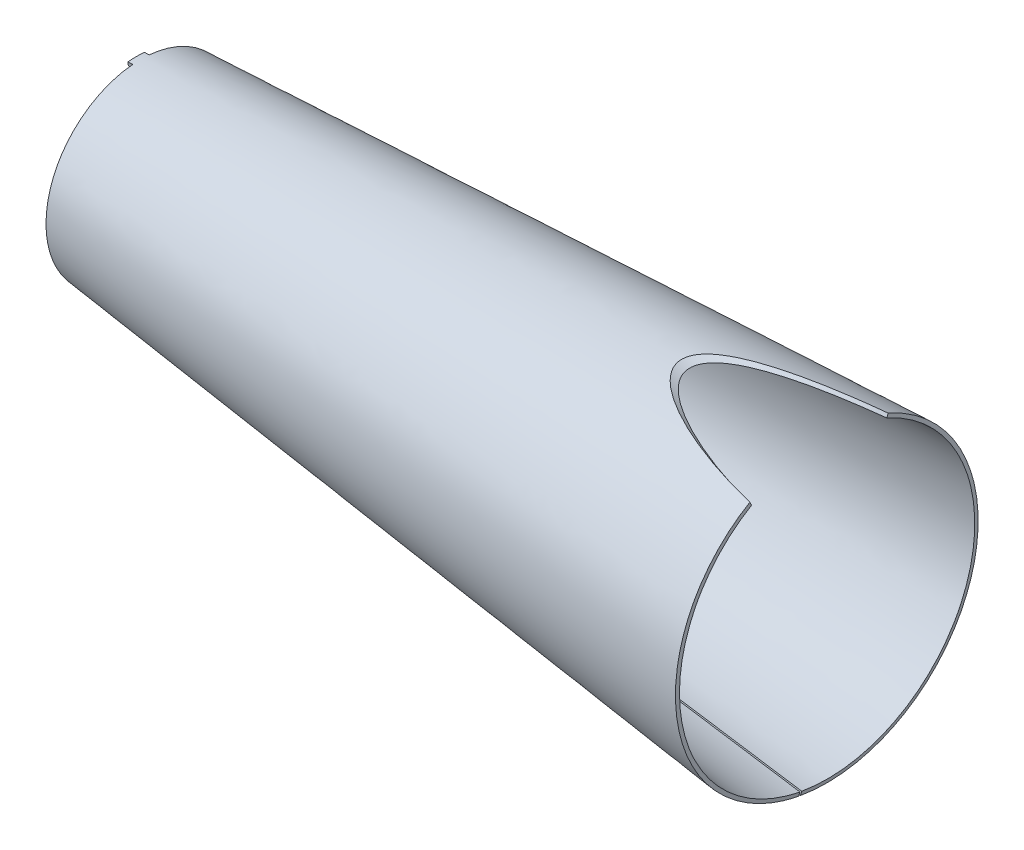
ISO-10303-21;
HEADER;
FILE_DESCRIPTION(('STEP AP214'),'2;1');
FILE_NAME('part.step','',(''),(''),'','','');
FILE_SCHEMA(('AUTOMOTIVE_DESIGN { 1 0 10303 214 1 1 1 1 }'));
ENDSEC;
DATA;
#1=APPLICATION_CONTEXT('core data for automotive mechanical design processes');
#2=APPLICATION_PROTOCOL_DEFINITION('international standard','automotive_design',2000,#1);
#3=PRODUCT_CONTEXT('',#1,'mechanical');
#4=PRODUCT('Part','Part','',(#3));
#5=PRODUCT_RELATED_PRODUCT_CATEGORY('part','',(#4));
#6=PRODUCT_DEFINITION_FORMATION('','',#4);
#7=PRODUCT_DEFINITION_CONTEXT('part definition',#1,'design');
#8=PRODUCT_DEFINITION('design','',#6,#7);
#9=PRODUCT_DEFINITION_SHAPE('','',#8);
#10=(LENGTH_UNIT() NAMED_UNIT(*) SI_UNIT(.MILLI.,.METRE.));
#11=(NAMED_UNIT(*) PLANE_ANGLE_UNIT() SI_UNIT($,.RADIAN.));
#12=(NAMED_UNIT(*) SI_UNIT($,.STERADIAN.) SOLID_ANGLE_UNIT());
#13=UNCERTAINTY_MEASURE_WITH_UNIT(LENGTH_MEASURE(1.E-05),#10,'distance_accuracy_value','');
#14=(GEOMETRIC_REPRESENTATION_CONTEXT(3) GLOBAL_UNCERTAINTY_ASSIGNED_CONTEXT((#13)) GLOBAL_UNIT_ASSIGNED_CONTEXT((#10,
#11,#12)) REPRESENTATION_CONTEXT('',''));
#15=CARTESIAN_POINT('',(0.,0.,0.));
#16=DIRECTION('',(0.,0.,1.));
#17=DIRECTION('',(1.,0.,0.));
#18=AXIS2_PLACEMENT_3D('',#15,#16,#17);
#19=CARTESIAN_POINT('',(360.294722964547,-101.661153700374,9.50772851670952));
#20=CARTESIAN_POINT('',(360.281159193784,-97.8193274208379,29.7976839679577));
#21=CARTESIAN_POINT('',(360.254687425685,-86.088863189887,47.7350527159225));
#22=CARTESIAN_POINT('',(360.187020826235,-51.9998608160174,71.043865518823));
#23=CARTESIAN_POINT('',(360.148341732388,-31.0324234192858,75.4652997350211));
#24=CARTESIAN_POINT('',(360.079214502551,9.56180295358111,67.9103687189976));
#25=CARTESIAN_POINT('',(360.051350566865,27.5330030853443,56.2420465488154));
#26=CARTESIAN_POINT('',(360.02179442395,50.9504105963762,22.2351882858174));
#27=CARTESIAN_POINT('',(360.021204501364,55.4408560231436,1.28401173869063));
#28=CARTESIAN_POINT('',(360.048859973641,48.0174495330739,-39.3328962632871));
#29=CARTESIAN_POINT('',(360.076063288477,36.40681466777,-57.3414077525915));
#30=CARTESIAN_POINT('',(360.144441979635,2.47458507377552,-80.8693349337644));
#31=CARTESIAN_POINT('',(360.183033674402,-18.4630600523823,-85.4292684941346));
#32=CARTESIAN_POINT('',(360.251485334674,-59.1102027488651,-78.1386352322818));
#33=CARTESIAN_POINT('',(360.278801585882,-77.1614672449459,-66.5845948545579));
#34=CARTESIAN_POINT('',(360.307811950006,-100.801371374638,-32.7183012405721));
#35=CARTESIAN_POINT('',(360.308510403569,-105.424427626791,-11.787901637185));
#36=CARTESIAN_POINT('',(360.295347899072,-101.836599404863,8.54836558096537));
#37=CARTESIAN_POINT('',(360.,-103.604820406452,9.87555743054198));
#38=CARTESIAN_POINT('',(360.,-99.6677428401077,30.6797038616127));
#39=CARTESIAN_POINT('',(360.,-87.6426519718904,49.0759765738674));
#40=CARTESIAN_POINT('',(360.,-52.6905916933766,72.9842562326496));
#41=CARTESIAN_POINT('',(360.,-31.1865047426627,77.5229680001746));
#42=CARTESIAN_POINT('',(360.,10.4461918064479,69.7788778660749));
#43=CARTESIAN_POINT('',(360.,28.8799532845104,57.8113343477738));
#44=CARTESIAN_POINT('',(360.,52.8973419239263,22.9341584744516));
#45=CARTESIAN_POINT('',(360.,57.5032321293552,1.44436006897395));
#46=CARTESIAN_POINT('',(360.,49.8892826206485,-40.2123335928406));
#47=CARTESIAN_POINT('',(360.,37.9794033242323,-58.6834038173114));
#48=CARTESIAN_POINT('',(360.,3.17745245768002,-82.8096668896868));
#49=CARTESIAN_POINT('',(360.,-18.2978475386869,-87.482690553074));
#50=CARTESIAN_POINT('',(360.,-59.9781315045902,-79.9989560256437));
#51=CARTESIAN_POINT('',(360.,-78.4863300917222,-68.1468572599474));
#52=CARTESIAN_POINT('',(360.,-102.721231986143,-33.4204712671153));
#53=CARTESIAN_POINT('',(360.,-107.461343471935,-11.9598794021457));
#54=CARTESIAN_POINT('',(360.,-103.784620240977,8.89185421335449));
#55=B_SPLINE_SURFACE_WITH_KNOTS('',1,3,((#19,#20,#21,#22,#23,#24,#25,#26,#27,#28,#29,#30,#31,
#32,#33,#34,#35,#36),(#37,#38,#39,#40,#41,#42,#43,#44,#45,#46,#47,#48,#49,#50,#51,#52,#53,#54)),
.UNSPECIFIED.,.F.,.F.,.F.,(2,2),(4,2,2,2,2,2,2,2,4),(0.,1.),(0.,0.125,0.25,0.375,0.5,0.625,0.75,
0.875,1.),.UNSPECIFIED.);
#56=CARTESIAN_POINT('',(360.,43.8857305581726,35.6789709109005));
#57=CARTESIAN_POINT('',(360.002828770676,43.7288596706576,35.6075180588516));
#58=CARTESIAN_POINT('',(360.005661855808,43.5723845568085,35.5351976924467));
#59=CARTESIAN_POINT('',(360.011335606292,43.2602463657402,35.388825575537));
#60=CARTESIAN_POINT('',(360.014176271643,43.1045832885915,35.314773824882));
#61=CARTESIAN_POINT('',(360.02237082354,42.6572524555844,35.0989106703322));
#62=CARTESIAN_POINT('',(360.027733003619,42.3666419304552,34.9549052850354));
#63=CARTESIAN_POINT('',(360.033103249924,42.077573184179,34.8078542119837));
#64=B_SPLINE_CURVE_WITH_KNOTS('',3,(#56,#57,#58,#59,#60,#61,#62,#63),.UNSPECIFIED.,.F.,.F.,(4,2,
2,4),(0.,0.517198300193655,1.03439664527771,2.00746261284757),.UNSPECIFIED.);
#65=CARTESIAN_POINT('',(360.,43.8857305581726,35.6789709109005));
#66=VERTEX_POINT('',#65);
#67=CARTESIAN_POINT('',(360.033098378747,42.0775606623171,34.8078466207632));
#68=VERTEX_POINT('',#67);
#69=EDGE_CURVE('E14',#66,#68,#64,.T.);
#70=CARTESIAN_POINT('',(360.,-103.784620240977,8.89185421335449));
#71=CARTESIAN_POINT('',(360.,-107.461343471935,-11.9598794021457));
#72=CARTESIAN_POINT('',(360.,-102.721231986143,-33.4204712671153));
#73=CARTESIAN_POINT('',(360.,-78.4863300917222,-68.1468572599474));
#74=CARTESIAN_POINT('',(360.,-59.9781315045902,-79.9989560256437));
#75=CARTESIAN_POINT('',(360.,-18.2978475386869,-87.482690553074));
#76=CARTESIAN_POINT('',(360.,3.17745245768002,-82.8096668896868));
#77=CARTESIAN_POINT('',(360.,37.9794033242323,-58.6834038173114));
#78=CARTESIAN_POINT('',(360.,49.8892826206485,-40.2123335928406));
#79=CARTESIAN_POINT('',(360.,57.5032321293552,1.44436006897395));
#80=CARTESIAN_POINT('',(360.,52.8973419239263,22.9341584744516));
#81=CARTESIAN_POINT('',(360.,28.8799532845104,57.8113343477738));
#82=CARTESIAN_POINT('',(360.,10.4461918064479,69.7788778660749));
#83=CARTESIAN_POINT('',(360.,-31.1865047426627,77.5229680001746));
#84=CARTESIAN_POINT('',(360.,-52.6905916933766,72.9842562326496));
#85=CARTESIAN_POINT('',(360.,-87.6426519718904,49.0759765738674));
#86=CARTESIAN_POINT('',(360.,-99.6677428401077,30.6797038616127));
#87=CARTESIAN_POINT('',(360.,-103.604820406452,9.87555743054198));
#88=B_SPLINE_CURVE_WITH_KNOTS('',3,(#70,#71,#72,#73,#74,#75,#76,#77,#78,#79,#80,#81,#82,#83,#84,
#85,#86,#87),.UNSPECIFIED.,.F.,.F.,(4,2,2,2,2,2,2,2,4),(0.,0.125,0.25,0.375,0.5,0.625,0.75,
0.875,1.),.UNSPECIFIED.);
#89=CARTESIAN_POINT('',(360.,-103.604820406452,9.87555743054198));
#90=VERTEX_POINT('',#89);
#91=EDGE_CURVE('E156',#66,#90,#88,.T.);
#92=CARTESIAN_POINT('',(360.,-103.604820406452,9.87555743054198));
#93=CARTESIAN_POINT('',(360.294722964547,-101.661153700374,9.50772851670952));
#94=B_SPLINE_CURVE_WITH_KNOTS('',1,(#92,#93),.UNSPECIFIED.,.F.,.F.,(2,2),(0.,1.),.UNSPECIFIED.);
#95=CARTESIAN_POINT('',(360.294722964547,-101.661153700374,9.50772851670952));
#96=VERTEX_POINT('',#95);
#97=EDGE_CURVE('E379',#90,#96,#94,.T.);
#98=CARTESIAN_POINT('',(360.033098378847,42.0775605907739,34.8078467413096));
#99=CARTESIAN_POINT('',(360.033697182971,41.5719718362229,35.6597490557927));
#100=CARTESIAN_POINT('',(360.034327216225,41.0501377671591,36.5020082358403));
#101=CARTESIAN_POINT('',(360.035651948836,39.9729699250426,38.1688765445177));
#102=CARTESIAN_POINT('',(360.036346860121,39.4175286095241,38.9934161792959));
#103=CARTESIAN_POINT('',(360.037798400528,38.27643769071,40.6194613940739));
#104=CARTESIAN_POINT('',(360.038554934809,37.6908349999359,41.420999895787));
#105=CARTESIAN_POINT('',(360.040126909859,36.4915019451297,42.9984798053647));
#106=CARTESIAN_POINT('',(360.040942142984,35.8778732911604,43.7744985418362));
#107=CARTESIAN_POINT('',(360.042629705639,34.6233853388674,45.300381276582));
#108=CARTESIAN_POINT('',(360.043501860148,33.9826114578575,46.0503155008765));
#109=CARTESIAN_POINT('',(360.045301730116,32.6747274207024,47.5234687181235));
#110=CARTESIAN_POINT('',(360.04622929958,32.0076879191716,48.2467504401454));
#111=CARTESIAN_POINT('',(360.048138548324,30.6481667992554,49.6660369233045));
#112=CARTESIAN_POINT('',(360.049120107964,29.9557424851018,50.3620965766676));
#113=CARTESIAN_POINT('',(360.051136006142,28.5463452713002,51.7263758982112));
#114=CARTESIAN_POINT('',(360.052170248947,27.8294176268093,52.3946423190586));
#115=CARTESIAN_POINT('',(360.054290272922,26.3719069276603,53.7027712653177));
#116=CARTESIAN_POINT('',(360.055375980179,25.6313582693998,54.3426721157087));
#117=CARTESIAN_POINT('',(360.05759776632,24.1274983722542,55.5935054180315));
#118=CARTESIAN_POINT('',(360.058733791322,23.3642117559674,56.2044674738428));
#119=CARTESIAN_POINT('',(360.061055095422,21.8157684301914,57.3968584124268));
#120=CARTESIAN_POINT('',(360.062240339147,21.0306275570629,57.9783078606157));
#121=CARTESIAN_POINT('',(360.064658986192,19.4393677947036,59.11110883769));
#122=CARTESIAN_POINT('',(360.065892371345,18.6332568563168,59.662471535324));
#123=CARTESIAN_POINT('',(360.068406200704,17.0009485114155,60.7345345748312));
#124=CARTESIAN_POINT('',(360.069686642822,16.1747519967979,61.2552362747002));
#125=CARTESIAN_POINT('',(360.072293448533,14.5031633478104,62.265413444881));
#126=CARTESIAN_POINT('',(360.073619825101,13.6577658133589,62.7548799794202));
#127=CARTESIAN_POINT('',(360.076317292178,11.9486650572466,63.7020237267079));
#128=CARTESIAN_POINT('',(360.07768840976,11.0849508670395,64.1596811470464));
#129=CARTESIAN_POINT('',(360.080474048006,9.34010555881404,65.0426445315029));
#130=CARTESIAN_POINT('',(360.081888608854,8.45895860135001,65.4679191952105));
#131=CARTESIAN_POINT('',(360.084759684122,6.68013505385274,66.2855560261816));
#132=CARTESIAN_POINT('',(360.086216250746,5.78243844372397,66.6778746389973));
#133=CARTESIAN_POINT('',(360.089169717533,3.97140109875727,67.4290394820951));
#134=CARTESIAN_POINT('',(360.090666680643,3.05803686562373,67.7878290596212));
#135=CARTESIAN_POINT('',(360.093699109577,1.21654766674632,68.4713771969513));
#136=CARTESIAN_POINT('',(360.095234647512,0.288396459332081,68.7960650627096));
#137=CARTESIAN_POINT('',(360.098342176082,-1.58178581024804,69.410852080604));
#138=CARTESIAN_POINT('',(360.099914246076,-2.52384506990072,69.7008654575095));
#139=CARTESIAN_POINT('',(360.103092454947,-4.42096526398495,70.2457476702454));
#140=CARTESIAN_POINT('',(360.104698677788,-5.37605549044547,70.5005145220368));
#141=CARTESIAN_POINT('',(360.107942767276,-7.29836312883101,70.9743457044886));
#142=CARTESIAN_POINT('',(360.109580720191,-8.26560997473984,71.1932906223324));
#143=CARTESIAN_POINT('',(360.11288302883,-10.2104397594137,71.5947424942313));
#144=CARTESIAN_POINT('',(360.114547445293,-11.1880439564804,71.7771464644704));
#145=CARTESIAN_POINT('',(360.117895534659,-13.1468751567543,72.104049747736));
#146=CARTESIAN_POINT('',(360.119579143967,-14.1280854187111,72.2486493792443));
#147=CARTESIAN_POINT('',(360.122961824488,-16.092097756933,72.4999249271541));
#148=CARTESIAN_POINT('',(360.124660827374,-17.0748842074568,72.6067229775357));
#149=CARTESIAN_POINT('',(360.128072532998,-19.0410199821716,72.7826336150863));
#150=CARTESIAN_POINT('',(360.129785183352,-20.0243598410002,72.8518520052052));
#151=CARTESIAN_POINT('',(360.133222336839,-21.9905734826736,72.9528365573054));
#152=CARTESIAN_POINT('',(360.134946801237,-22.9734426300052,72.9846929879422));
#153=CARTESIAN_POINT('',(360.138405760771,-24.9376851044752,73.011186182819));
#154=CARTESIAN_POINT('',(360.140140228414,-25.9190574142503,73.0058984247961));
#155=CARTESIAN_POINT('',(360.143617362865,-27.8792759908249,72.9583343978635));
#156=CARTESIAN_POINT('',(360.145360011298,-28.8581237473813,72.9161195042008));
#157=CARTESIAN_POINT('',(360.148851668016,-30.8122626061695,72.7949315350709));
#158=CARTESIAN_POINT('',(360.150600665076,-31.7875566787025,72.7160063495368));
#159=CARTESIAN_POINT('',(360.154103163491,-33.7335573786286,72.5216274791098));
#160=CARTESIAN_POINT('',(360.155856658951,-34.7042674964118,72.4062087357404));
#161=CARTESIAN_POINT('',(360.159366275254,-36.6400695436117,72.1390720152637));
#162=CARTESIAN_POINT('',(360.16112239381,-37.6051645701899,71.9873764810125));
#163=CARTESIAN_POINT('',(360.164635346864,-39.5287060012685,71.6479151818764));
#164=CARTESIAN_POINT('',(360.166392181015,-40.48715422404,71.4601597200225));
#165=CARTESIAN_POINT('',(360.169904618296,-42.3963722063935,71.0488074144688));
#166=CARTESIAN_POINT('',(360.171660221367,-43.3471416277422,70.8252090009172));
#167=CARTESIAN_POINT('',(360.175168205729,-45.2399730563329,70.3423995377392));
#168=CARTESIAN_POINT('',(360.176920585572,-46.1820316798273,70.0831752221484));
#169=CARTESIAN_POINT('',(360.180420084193,-48.0564137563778,69.5293425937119));
#170=CARTESIAN_POINT('',(360.182167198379,-48.9887298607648,69.2347094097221));
#171=CARTESIAN_POINT('',(360.18565407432,-50.8426006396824,68.6102875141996));
#172=CARTESIAN_POINT('',(360.187393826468,-51.7641430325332,68.2804623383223));
#173=CARTESIAN_POINT('',(360.190863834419,-53.595441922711,67.585884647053));
#174=CARTESIAN_POINT('',(360.192594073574,-54.5051801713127,67.2210840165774));
#175=CARTESIAN_POINT('',(360.196042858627,-56.3118483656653,66.4567831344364));
#176=CARTESIAN_POINT('',(360.197761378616,-57.2087529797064,66.057223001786));
#177=CARTESIAN_POINT('',(360.201184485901,-58.988733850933,65.2236302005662));
#178=CARTESIAN_POINT('',(360.202889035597,-59.8717764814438,64.7895257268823));
#179=CARTESIAN_POINT('',(360.206281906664,-61.6230157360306,63.8870701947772));
#180=CARTESIAN_POINT('',(360.207970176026,-62.4911691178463,63.418635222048));
#181=CARTESIAN_POINT('',(360.211328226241,-64.2116154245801,62.4477440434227));
#182=CARTESIAN_POINT('',(360.212997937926,-65.06385405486,61.9451916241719));
#183=CARTESIAN_POINT('',(360.216316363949,-66.7514574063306,60.9062867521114));
#184=CARTESIAN_POINT('',(360.217964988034,-67.5867552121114,60.3698256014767));
#185=CARTESIAN_POINT('',(360.221236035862,-69.2376617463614,59.264544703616));
#186=CARTESIAN_POINT('',(360.222858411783,-70.0532356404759,58.6956729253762));
#187=CARTESIAN_POINT('',(360.226069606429,-71.6593762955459,57.5291405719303));
#188=CARTESIAN_POINT('',(360.227658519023,-72.4500173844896,56.9315823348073));
#189=CARTESIAN_POINT('',(360.230799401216,-74.0055076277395,55.708702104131));
#190=CARTESIAN_POINT('',(360.232351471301,-74.7704300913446,55.0834733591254));
#191=CARTESIAN_POINT('',(360.235417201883,-76.2739203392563,53.8061460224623));
#192=CARTESIAN_POINT('',(360.236930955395,-77.0125541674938,53.1541251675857));
#193=CARTESIAN_POINT('',(360.239918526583,-78.4629017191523,51.8241053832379));
#194=CARTESIAN_POINT('',(360.24139242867,-79.1746738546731,51.1461701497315));
#195=CARTESIAN_POINT('',(360.244299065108,-80.5707314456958,49.7652133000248));
#196=CARTESIAN_POINT('',(360.245731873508,-81.2550673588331,49.0622426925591));
#197=CARTESIAN_POINT('',(360.248555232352,-82.5956847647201,47.632106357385));
#198=CARTESIAN_POINT('',(360.249945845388,-83.2520084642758,46.9049801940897));
#199=CARTESIAN_POINT('',(360.252683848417,-84.5360329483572,45.4274237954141));
#200=CARTESIAN_POINT('',(360.254031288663,-85.1637673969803,44.6770228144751));
#201=CARTESIAN_POINT('',(360.256682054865,-86.3900444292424,43.1538076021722));
#202=CARTESIAN_POINT('',(360.257985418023,-86.9886118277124,42.3810133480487));
#203=CARTESIAN_POINT('',(360.260547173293,-88.1559856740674,40.8139021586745));
#204=CARTESIAN_POINT('',(360.261805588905,-88.7248077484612,40.0195968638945));
#205=CARTESIAN_POINT('',(360.264276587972,-89.832122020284,38.4103538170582));
#206=CARTESIAN_POINT('',(360.265489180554,-90.3706202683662,37.5954202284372));
#207=CARTESIAN_POINT('',(360.267867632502,-91.4167183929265,35.9458103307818));
#208=CARTESIAN_POINT('',(360.269033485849,-91.9243142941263,35.1111315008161));
#209=CARTESIAN_POINT('',(360.27131748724,-92.9080399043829,33.4229201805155));
#210=CARTESIAN_POINT('',(360.27243561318,-93.3841550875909,32.5693792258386));
#211=CARTESIAN_POINT('',(360.274623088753,-94.3043523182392,30.84433180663));
#212=CARTESIAN_POINT('',(360.27569239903,-94.7484086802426,29.9728116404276));
#213=CARTESIAN_POINT('',(360.277781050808,-95.6039223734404,28.212692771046));
#214=CARTESIAN_POINT('',(360.278800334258,-96.0153421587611,27.3240758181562));
#215=CARTESIAN_POINT('',(360.28078760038,-96.805017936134,25.5306488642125));
#216=CARTESIAN_POINT('',(360.281755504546,-97.1832237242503,24.6258167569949));
#217=CARTESIAN_POINT('',(360.283638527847,-97.9059080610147,22.8008431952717));
#218=CARTESIAN_POINT('',(360.284553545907,-98.2503228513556,21.8806764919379));
#219=CARTESIAN_POINT('',(360.286329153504,-98.9048626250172,20.0259152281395));
#220=CARTESIAN_POINT('',(360.287189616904,-99.2149093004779,19.0912930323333));
#221=CARTESIAN_POINT('',(360.288854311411,-99.80015277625,17.2085000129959));
#222=CARTESIAN_POINT('',(360.289658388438,-100.07525563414,16.2602999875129));
#223=CARTESIAN_POINT('',(360.291208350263,-100.590047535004,14.3512267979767));
#224=CARTESIAN_POINT('',(360.291954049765,-100.829625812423,13.3903237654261));
#225=CARTESIAN_POINT('',(360.293385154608,-101.272824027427,11.4567201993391));
#226=CARTESIAN_POINT('',(360.294070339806,-101.476315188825,10.4839901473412));
#227=CARTESIAN_POINT('',(360.294722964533,-101.661153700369,9.50772851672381));
#228=B_SPLINE_CURVE_WITH_KNOTS('',3,(#98,#99,#100,#101,#102,#103,#104,#105,#106,#107,#108,#109,
#110,#111,#112,#113,#114,#115,#116,#117,#118,#119,#120,#121,#122,#123,#124,#125,#126,#127,#128,
#129,#130,#131,#132,#133,#134,#135,#136,#137,#138,#139,#140,#141,#142,#143,#144,#145,#146,#147,
#148,#149,#150,#151,#152,#153,#154,#155,#156,#157,#158,#159,#160,#161,#162,#163,#164,#165,#166,
#167,#168,#169,#170,#171,#172,#173,#174,#175,#176,#177,#178,#179,#180,#181,#182,#183,#184,#185,
#186,#187,#188,#189,#190,#191,#192,#193,#194,#195,#196,#197,#198,#199,#200,#201,#202,#203,#204,
#205,#206,#207,#208,#209,#210,#211,#212,#213,#214,#215,#216,#217,#218,#219,#220,#221,#222,#223,
#224,#225,#226,#227),.UNSPECIFIED.,.F.,.F.,(4,2,2,2,2,2,2,2,2,2,2,2,2,2,2,2,2,2,2,2,2,2,2,2,2,2,
2,2,2,2,2,2,2,2,2,2,2,2,2,2,2,2,2,2,2,2,2,2,2,2,2,2,2,2,2,2,2,2,2,2,2,2,2,2,4),(0.,
2.97172375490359,5.9535192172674,8.93080921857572,11.898040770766,14.8565433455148,
17.8075686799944,20.7522993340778,23.6918576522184,26.6273150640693,29.559701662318,
32.4900159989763,35.4192350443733,38.3483242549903,41.2782476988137,44.2099781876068,
47.1445073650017,50.0828556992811,53.0260823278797,55.975294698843,58.931657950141,
61.8964039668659,64.8708400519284,67.8535446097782,70.828251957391,73.7932585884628,
76.7498735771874,79.6993304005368,82.6427956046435,85.5813778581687,88.5161373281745,
91.4480953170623,94.3782441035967,97.3075569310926,100.236998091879,103.167533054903,
106.100138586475,109.035812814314,111.975585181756,114.920526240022,117.87175722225,
120.830459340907,123.797882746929,126.775355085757,129.757749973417,132.730198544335,
135.693296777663,138.648332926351,141.596521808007,144.539013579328,147.476902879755,
150.411238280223,153.343031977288,156.273269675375,159.202920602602,162.132947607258,
165.064317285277,167.998010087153,170.935030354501,173.876416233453,176.823249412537,
179.776664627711,182.737858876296,185.708100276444,188.688736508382),.UNSPECIFIED.);
#229=EDGE_CURVE('E383',#68,#96,#228,.T.);
#230=ORIENTED_EDGE('',*,*,#69,.F.);
#231=ORIENTED_EDGE('',*,*,#91,.T.);
#232=ORIENTED_EDGE('',*,*,#97,.T.);
#233=ORIENTED_EDGE('',*,*,#229,.F.);
#234=EDGE_LOOP('',(#230,#231,#232,#233));
#235=FACE_BOUND('',#234,.T.);
#236=ADVANCED_FACE('F59',(#235),#55,.F.);
#237=CARTESIAN_POINT('',(0.294314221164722,-47.1159871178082,9.28302272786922));
#238=CARTESIAN_POINT('',(0.287245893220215,-45.8377350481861,15.7653518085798));
#239=CARTESIAN_POINT('',(0.276594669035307,-43.3101716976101,21.6776975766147));
#240=CARTESIAN_POINT('',(0.251088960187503,-36.3531998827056,31.9813469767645));
#241=CARTESIAN_POINT('',(0.236235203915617,-31.9225594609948,36.3719980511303));
#242=CARTESIAN_POINT('',(0.203760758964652,-21.7590555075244,43.222338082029));
#243=CARTESIAN_POINT('',(0.186035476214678,-16.0273196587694,45.6812747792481));
#244=CARTESIAN_POINT('',(0.149468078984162,-3.86888337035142,48.2638125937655));
#245=CARTESIAN_POINT('',(0.13064350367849,2.55697356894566,48.3889945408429));
#246=CARTESIAN_POINT('',(0.0954197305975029,15.5306741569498,45.8981441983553));
#247=CARTESIAN_POINT('',(0.0793273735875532,21.45285090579,43.4021598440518));
#248=CARTESIAN_POINT('',(0.0533465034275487,31.7890135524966,36.5012691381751));
#249=CARTESIAN_POINT('',(0.0432915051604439,36.2016353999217,32.0951953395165));
#250=CARTESIAN_POINT('',(0.029316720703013,43.1037829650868,21.9704235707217));
#251=CARTESIAN_POINT('',(0.0253466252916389,45.5925244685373,16.2528575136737));
#252=CARTESIAN_POINT('',(0.0246567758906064,48.2384396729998,4.10989376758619));
#253=CARTESIAN_POINT('',(0.0281119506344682,48.3971627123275,-2.31464074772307));
#254=CARTESIAN_POINT('',(0.042336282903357,45.9735620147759,-15.3002800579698));
#255=CARTESIAN_POINT('',(0.052974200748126,43.5081542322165,-21.235089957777));
#256=CARTESIAN_POINT('',(0.07896448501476,36.6604682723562,-31.6065734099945));
#257=CARTESIAN_POINT('',(0.0941994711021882,32.2770516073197,-36.041904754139));
#258=CARTESIAN_POINT('',(0.127028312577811,22.1875235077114,-42.9966894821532));
#259=CARTESIAN_POINT('',(0.144703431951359,16.4825335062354,-45.5153822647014));
#260=CARTESIAN_POINT('',(0.181173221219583,4.35195163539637,-48.2252662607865));
#261=CARTESIAN_POINT('',(0.20005568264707,-2.07283442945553,-48.4180206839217));
#262=CARTESIAN_POINT('',(0.234946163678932,-15.0741322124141,-46.0623320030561));
#263=CARTESIAN_POINT('',(0.250644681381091,-21.0237373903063,-43.6275652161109));
#264=CARTESIAN_POINT('',(0.276352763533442,-31.4342948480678,-36.8316365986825));
#265=CARTESIAN_POINT('',(0.286418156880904,-35.893862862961,-32.4693352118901));
#266=CARTESIAN_POINT('',(0.300297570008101,-42.9018943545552,-22.4109840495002));
#267=CARTESIAN_POINT('',(0.304148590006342,-45.4495652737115,-16.7160570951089));
#268=CARTESIAN_POINT('',(0.305061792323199,-48.2182678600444,-4.59430645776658));
#269=CARTESIAN_POINT('',(0.30206343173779,-48.4406748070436,1.83231634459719));
#270=CARTESIAN_POINT('',(0.295347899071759,-47.2923668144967,8.33892025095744));
#271=CARTESIAN_POINT('',(0.,-49.0569000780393,9.6654309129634));
#272=CARTESIAN_POINT('',(0.,-47.727975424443,16.4103887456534));
#273=CARTESIAN_POINT('',(0.,-45.0965849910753,22.5716123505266));
#274=CARTESIAN_POINT('',(0.,-37.8535141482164,33.3053077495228));
#275=CARTESIAN_POINT('',(0.,-33.2418337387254,37.8777795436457));
#276=CARTESIAN_POINT('',(0.,-22.6628245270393,45.0126879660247));
#277=CARTESIAN_POINT('',(0.,-16.6954957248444,47.5751245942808));
#278=CARTESIAN_POINT('',(0.,-4.02983131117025,50.2686793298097));
#279=CARTESIAN_POINT('',(0.,2.668504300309,50.3997974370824));
#280=CARTESIAN_POINT('',(0.,16.1715407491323,47.8094317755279));
#281=CARTESIAN_POINT('',(0.,22.3458444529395,45.2088807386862));
#282=CARTESIAN_POINT('',(0.,33.1156214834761,38.0195695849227));
#283=CARTESIAN_POINT('',(0.,37.7110948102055,33.4308094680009));
#284=CARTESIAN_POINT('',(0.,44.8988097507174,22.8876074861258));
#285=CARTESIAN_POINT('',(0.,47.4910513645,16.9331656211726));
#286=CARTESIAN_POINT('',(0.,50.2479015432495,4.2811274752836));
#287=CARTESIAN_POINT('',(0.,50.4125101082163,-2.41646880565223));
#288=CARTESIAN_POINT('',(0.,47.8896928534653,-15.9322884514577));
#289=CARTESIAN_POINT('',(0.,45.3200462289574,-22.1195178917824));
#290=CARTESIAN_POINT('',(0.,38.184674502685,-32.9251073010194));
#291=CARTESIAN_POINT('',(0.,33.6189494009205,-37.5434672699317));
#292=CARTESIAN_POINT('',(0.,23.1118182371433,-44.7838090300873));
#293=CARTESIAN_POINT('',(0.,17.1704121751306,-47.4057908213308));
#294=CARTESIAN_POINT('',(0.,4.53231660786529,-50.2258675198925));
#295=CARTESIAN_POINT('',(0.,-2.16437289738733,-50.4239624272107));
#296=CARTESIAN_POINT('',(0.,-15.6926378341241,-47.9687566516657));
#297=CARTESIAN_POINT('',(0.,-21.8926383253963,-45.4300786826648));
#298=CARTESIAN_POINT('',(0.,-32.7337699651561,-38.3488247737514));
#299=CARTESIAN_POINT('',(0.,-37.3749011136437,-33.8062488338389));
#300=CARTESIAN_POINT('',(0.,-44.6676886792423,-23.3354511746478));
#301=CARTESIAN_POINT('',(0.,-47.3193450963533,-17.4072294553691));
#302=CARTESIAN_POINT('',(0.,-50.2025778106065,-4.78339242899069));
#303=CARTESIAN_POINT('',(0.,-50.4341541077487,1.91222287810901));
#304=CARTESIAN_POINT('',(0.,-49.2403876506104,8.68240888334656));
#305=B_SPLINE_SURFACE_WITH_KNOTS('',1,3,((#237,#238,#239,#240,#241,#242,#243,#244,#245,#246,
#247,#248,#249,#250,#251,#252,#253,#254,#255,#256,#257,#258,#259,#260,#261,#262,#263,#264,#265,
#266,#267,#268,#269,#270),(#271,#272,#273,#274,#275,#276,#277,#278,#279,#280,#281,#282,#283,
#284,#285,#286,#287,#288,#289,#290,#291,#292,#293,#294,#295,#296,#297,#298,#299,#300,#301,#302,
#303,#304)),.UNSPECIFIED.,.F.,.F.,.F.,(2,2),(4,2,2,2,2,2,2,2,2,2,2,2,2,2,2,2,4),(0.,1.),(0.,
0.0625,0.125,0.1875,0.25,0.3125,0.375,0.4375,0.5,0.5625,0.625,0.6875,0.75,0.8125,0.875,0.9375,
1.),.UNSPECIFIED.);
#306=CARTESIAN_POINT('',(0.0258323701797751,47.8270073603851,4.18432095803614));
#307=CARTESIAN_POINT('',(0.0259460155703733,47.8570327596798,3.84043001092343));
#308=CARTESIAN_POINT('',(0.0260709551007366,47.8833147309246,3.49621232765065));
#309=CARTESIAN_POINT('',(0.0263436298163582,47.9284498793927,2.80631087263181));
#310=CARTESIAN_POINT('',(0.0264914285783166,47.9472818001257,2.46062571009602));
#311=CARTESIAN_POINT('',(0.02680986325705,47.9774501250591,1.76788304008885));
#312=CARTESIAN_POINT('',(0.0269805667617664,47.9887637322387,1.42082453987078));
#313=CARTESIAN_POINT('',(0.027344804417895,48.0038300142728,0.725428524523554));
#314=CARTESIAN_POINT('',(0.0275384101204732,48.0075582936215,0.377090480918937));
#315=CARTESIAN_POINT('',(0.0279484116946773,48.0073878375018,-0.32077174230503));
#316=CARTESIAN_POINT('',(0.0281648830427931,48.0034630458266,-0.670295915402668));
#317=CARTESIAN_POINT('',(0.0286205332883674,47.987920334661,-1.37043799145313));
#318=CARTESIAN_POINT('',(0.028859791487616,47.9762746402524,-1.72105527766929));
#319=CARTESIAN_POINT('',(0.0293608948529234,47.9452231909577,-2.42329148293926));
#320=CARTESIAN_POINT('',(0.0296228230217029,47.9257878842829,-2.77490909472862));
#321=CARTESIAN_POINT('',(0.0301690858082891,47.8790917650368,-3.47905473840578));
#322=CARTESIAN_POINT('',(0.0304535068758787,47.8517995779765,-3.83158069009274));
#323=CARTESIAN_POINT('',(0.0307484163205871,47.8206249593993,-4.18376256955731));
#324=B_SPLINE_CURVE_WITH_KNOTS('',3,(#306,#307,#308,#309,#310,#311,#312,#313,#314,#315,#316,
#317,#318,#319,#320,#321,#322,#323),.UNSPECIFIED.,.F.,.F.,(4,2,2,2,2,2,2,2,4),(0.,
1.03557719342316,2.07408814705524,3.11573387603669,4.16072442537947,5.20927903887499,
6.26162630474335,7.31800427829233,8.37866057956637),.UNSPECIFIED.);
#325=CARTESIAN_POINT('',(0.0258443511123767,47.8271095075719,4.18432988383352));
#326=VERTEX_POINT('',#325);
#327=CARTESIAN_POINT('',(0.030757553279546,47.8206932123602,-4.18376860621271));
#328=VERTEX_POINT('',#327);
#329=EDGE_CURVE('E384',#326,#328,#324,.T.);
#330=CARTESIAN_POINT('',(0.0258563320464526,47.8272116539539,4.18433881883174));
#331=CARTESIAN_POINT('',(0.0236818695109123,47.9947349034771,4.19899520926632));
#332=CARTESIAN_POINT('',(0.021507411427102,48.1622581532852,4.21365159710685));
#333=CARTESIAN_POINT('',(0.0171585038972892,48.4973046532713,4.2429643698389));
#334=CARTESIAN_POINT('',(0.0149840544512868,48.6648279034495,4.25762075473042));
#335=CARTESIAN_POINT('',(0.00853972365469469,49.1613109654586,4.30105739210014));
#336=CARTESIAN_POINT('',(0.00426985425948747,49.4902707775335,4.32983764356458));
#337=CARTESIAN_POINT('',(0.,49.8192305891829,4.35861790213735));
#338=B_SPLINE_CURVE_WITH_KNOTS('',3,(#330,#331,#332,#333,#334,#335,#336,#337),.UNSPECIFIED.,.F.,
.F.,(4,2,2,4),(0.,0.504531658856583,1.00906331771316,1.99979528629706),.UNSPECIFIED.);
#339=CARTESIAN_POINT('',(0.,49.8192305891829,4.35861790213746));
#340=VERTEX_POINT('',#339);
#341=EDGE_CURVE('E497',#326,#340,#338,.T.);
#342=CARTESIAN_POINT('',(0.,-49.0569000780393,9.6654309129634));
#343=CARTESIAN_POINT('',(0.,-47.727975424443,16.4103887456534));
#344=CARTESIAN_POINT('',(0.,-45.0965849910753,22.5716123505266));
#345=CARTESIAN_POINT('',(0.,-37.8535141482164,33.3053077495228));
#346=CARTESIAN_POINT('',(0.,-33.2418337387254,37.8777795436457));
#347=CARTESIAN_POINT('',(0.,-22.6628245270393,45.0126879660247));
#348=CARTESIAN_POINT('',(0.,-16.6954957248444,47.5751245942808));
#349=CARTESIAN_POINT('',(0.,-4.02983131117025,50.2686793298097));
#350=CARTESIAN_POINT('',(0.,2.668504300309,50.3997974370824));
#351=CARTESIAN_POINT('',(0.,16.1715407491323,47.8094317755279));
#352=CARTESIAN_POINT('',(0.,22.3458444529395,45.2088807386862));
#353=CARTESIAN_POINT('',(0.,33.1156214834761,38.0195695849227));
#354=CARTESIAN_POINT('',(0.,37.7110948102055,33.4308094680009));
#355=CARTESIAN_POINT('',(0.,44.8988097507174,22.8876074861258));
#356=CARTESIAN_POINT('',(0.,47.4910513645,16.9331656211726));
#357=CARTESIAN_POINT('',(0.,50.2479015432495,4.2811274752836));
#358=CARTESIAN_POINT('',(0.,50.4125101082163,-2.41646880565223));
#359=CARTESIAN_POINT('',(0.,47.8896928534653,-15.9322884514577));
#360=CARTESIAN_POINT('',(0.,45.3200462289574,-22.1195178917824));
#361=CARTESIAN_POINT('',(0.,38.184674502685,-32.9251073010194));
#362=CARTESIAN_POINT('',(0.,33.6189494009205,-37.5434672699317));
#363=CARTESIAN_POINT('',(0.,23.1118182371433,-44.7838090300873));
#364=CARTESIAN_POINT('',(0.,17.1704121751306,-47.4057908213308));
#365=CARTESIAN_POINT('',(0.,4.53231660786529,-50.2258675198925));
#366=CARTESIAN_POINT('',(0.,-2.16437289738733,-50.4239624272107));
#367=CARTESIAN_POINT('',(0.,-15.6926378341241,-47.9687566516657));
#368=CARTESIAN_POINT('',(0.,-21.8926383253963,-45.4300786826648));
#369=CARTESIAN_POINT('',(0.,-32.7337699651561,-38.3488247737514));
#370=CARTESIAN_POINT('',(0.,-37.3749011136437,-33.8062488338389));
#371=CARTESIAN_POINT('',(0.,-44.6676886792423,-23.3354511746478));
#372=CARTESIAN_POINT('',(0.,-47.3193450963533,-17.4072294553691));
#373=CARTESIAN_POINT('',(0.,-50.2025778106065,-4.78339242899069));
#374=CARTESIAN_POINT('',(0.,-50.4341541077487,1.91222287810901));
#375=CARTESIAN_POINT('',(0.,-49.2403876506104,8.68240888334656));
#376=B_SPLINE_CURVE_WITH_KNOTS('',3,(#342,#343,#344,#345,#346,#347,#348,#349,#350,#351,#352,
#353,#354,#355,#356,#357,#358,#359,#360,#361,#362,#363,#364,#365,#366,#367,#368,#369,#370,#371,
#372,#373,#374,#375),.UNSPECIFIED.,.F.,.F.,(4,2,2,2,2,2,2,2,2,2,2,2,2,2,2,2,4),(0.,0.0625,0.125,
0.1875,0.25,0.3125,0.375,0.4375,0.5,0.5625,0.625,0.6875,0.75,0.8125,0.875,0.9375,1.),.UNSPECIFIED.);
#377=CARTESIAN_POINT('',(0.,49.8127798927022,-4.35805353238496));
#378=VERTEX_POINT('',#377);
#379=EDGE_CURVE('E350',#340,#378,#376,.T.);
#380=CARTESIAN_POINT('',(0.,49.8127798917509,-4.35805354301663));
#381=CARTESIAN_POINT('',(0.00258715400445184,49.6452624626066,-4.34339766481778));
#382=CARTESIAN_POINT('',(0.00517434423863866,49.4777450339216,-4.32874178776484));
#383=CARTESIAN_POINT('',(0.0103487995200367,49.142710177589,-4.2994300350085));
#384=CARTESIAN_POINT('',(0.0129360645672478,48.9751927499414,-4.28477415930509));
#385=CARTESIAN_POINT('',(0.020604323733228,48.4787040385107,-4.24133702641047));
#386=CARTESIAN_POINT('',(0.0256854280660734,48.1497327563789,-4.21255576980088));
#387=CARTESIAN_POINT('',(0.0307666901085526,47.8207614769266,-4.18377451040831));
#388=B_SPLINE_CURVE_WITH_KNOTS('',3,(#380,#381,#382,#383,#384,#385,#386,#387),.UNSPECIFIED.,.F.,
.F.,(4,2,2,4),(0.,0.504531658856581,1.00906331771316,1.9998642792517),.UNSPECIFIED.);
#389=EDGE_CURVE('E311',#378,#328,#388,.T.);
#390=ORIENTED_EDGE('',*,*,#329,.F.);
#391=ORIENTED_EDGE('',*,*,#341,.T.);
#392=ORIENTED_EDGE('',*,*,#379,.T.);
#393=ORIENTED_EDGE('',*,*,#389,.T.);
#394=EDGE_LOOP('',(#390,#391,#392,#393));
#395=FACE_BOUND('',#394,.T.);
#396=ADVANCED_FACE('F314',(#395),#305,.T.);
#397=CARTESIAN_POINT('',(0.,-49.0569000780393,9.6654309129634));
#398=CARTESIAN_POINT('',(360.,-103.604820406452,9.87555743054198));
#399=CARTESIAN_POINT('',(0.,-46.3990507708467,23.1553465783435));
#400=CARTESIAN_POINT('',(360.,-99.6677428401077,30.6797038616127));
#401=CARTESIAN_POINT('',(0.,-38.5313383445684,34.3103253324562));
#402=CARTESIAN_POINT('',(360.,-87.6426519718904,49.0759765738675));
#403=CARTESIAN_POINT('',(0.,-17.3733199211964,48.5801421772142));
#404=CARTESIAN_POINT('',(360.,-52.6905916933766,72.9842562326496));
#405=CARTESIAN_POINT('',(0.,-4.08301392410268,51.6949802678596));
#406=CARTESIAN_POINT('',(360.,-31.1865047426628,77.5229680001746));
#407=CARTESIAN_POINT('',(0.,22.923058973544,46.5142489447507));
#408=CARTESIAN_POINT('',(360.,10.4461918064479,69.7788778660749));
#409=CARTESIAN_POINT('',(0.,34.1172373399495,38.7024104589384));
#410=CARTESIAN_POINT('',(360.,28.8799532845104,57.8113343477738));
#411=CARTESIAN_POINT('',(0.,48.4926672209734,17.6160064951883));
#412=CARTESIAN_POINT('',(360.,52.8973419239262,22.9341584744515));
#413=CARTESIAN_POINT('',(0.,51.6739187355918,4.34144101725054));
#414=CARTESIAN_POINT('',(360.,57.5032321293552,1.44436006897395));
#415=CARTESIAN_POINT('',(0.,46.6282842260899,-22.6901982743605));
#416=CARTESIAN_POINT('',(360.,49.8892826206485,-40.2123335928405));
#417=CARTESIAN_POINT('',(0.,38.8725149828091,-33.9232963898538));
#418=CARTESIAN_POINT('',(360.,37.9794033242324,-58.6834038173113));
#419=CARTESIAN_POINT('',(0.,17.8582526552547,-48.4039799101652));
#420=CARTESIAN_POINT('',(360.,3.17745245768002,-82.8096668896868));
#421=CARTESIAN_POINT('',(0.,4.59975957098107,-51.6515653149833));
#422=CARTESIAN_POINT('',(360.,-18.2978475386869,-87.482690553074));
#423=CARTESIAN_POINT('',(0.,-22.4567703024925,-46.7411537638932));
#424=CARTESIAN_POINT('',(360.,-59.9781315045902,-79.9989560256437));
#425=CARTESIAN_POINT('',(0.,-33.7285073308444,-39.0416476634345));
#426=CARTESIAN_POINT('',(360.,-78.4863300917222,-68.1468572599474));
#427=CARTESIAN_POINT('',(0.,-48.3140824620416,-18.1000523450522));
#428=CARTESIAN_POINT('',(360.,-102.721231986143,-33.4204712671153));
#429=CARTESIAN_POINT('',(0.,-51.6279205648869,-4.85796312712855));
#430=CARTESIAN_POINT('',(360.,-107.461343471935,-11.9598794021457));
#431=CARTESIAN_POINT('',(0.,-49.2403876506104,8.68240888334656));
#432=CARTESIAN_POINT('',(360.,-103.784620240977,8.89185421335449));
#433=B_SPLINE_SURFACE_WITH_KNOTS('',3,1,((#397,#398),(#399,#400),(#401,#402),(#403,#404),(#405,
#406),(#407,#408),(#409,#410),(#411,#412),(#413,#414),(#415,#416),(#417,#418),(#419,#420),(#421,
#422),(#423,#424),(#425,#426),(#427,#428),(#429,#430),(#431,#432)),.UNSPECIFIED.,.F.,.F.,.F.,(4,
2,2,2,2,2,2,2,4),(2,2),(0.,0.125,0.25,0.375,0.5,0.625,0.75,0.875,1.),(0.,1.),.UNSPECIFIED.);
#434=OFFSET_SURFACE('',#433,2.,.F.);
#435=CARTESIAN_POINT('',(360.033098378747,42.0775606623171,34.8078466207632));
#436=CARTESIAN_POINT('',(359.120158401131,42.1634780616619,34.6334734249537));
#437=CARTESIAN_POINT('',(358.208193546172,42.2512478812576,34.4549016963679));
#438=CARTESIAN_POINT('',(356.38615755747,42.4303566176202,34.0891764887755));
#439=CARTESIAN_POINT('',(355.476086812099,42.5216962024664,33.9020214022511));
#440=CARTESIAN_POINT('',(353.658009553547,42.7077882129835,33.5189857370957));
#441=CARTESIAN_POINT('',(352.750003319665,42.8025410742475,33.3231040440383));
#442=CARTESIAN_POINT('',(350.936237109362,42.9953094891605,32.9224237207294));
#443=CARTESIAN_POINT('',(350.030477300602,43.0933252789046,32.7176244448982));
#444=CARTESIAN_POINT('',(348.221394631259,43.2924732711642,32.2988785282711));
#445=CARTESIAN_POINT('',(347.318071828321,43.3936055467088,32.0849316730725));
#446=CARTESIAN_POINT('',(345.508182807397,43.5995134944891,31.6461874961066));
#447=CARTESIAN_POINT('',(344.601633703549,43.7043085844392,31.4213286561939));
#448=CARTESIAN_POINT('',(342.7914153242,43.9167719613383,30.9617246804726));
#449=CARTESIAN_POINT('',(341.88774594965,44.0244401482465,30.7269798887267));
#450=CARTESIAN_POINT('',(340.083516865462,44.2425123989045,30.2472066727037));
#451=CARTESIAN_POINT('',(339.18295701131,44.3529163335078,30.0021787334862));
#452=CARTESIAN_POINT('',(337.385195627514,44.5763257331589,29.5013726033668));
#453=CARTESIAN_POINT('',(336.487993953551,44.6893310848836,29.245594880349));
#454=CARTESIAN_POINT('',(334.697220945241,44.9178114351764,28.7227416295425));
#455=CARTESIAN_POINT('',(333.803649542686,45.0332863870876,28.4556663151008));
#456=CARTESIAN_POINT('',(331.938211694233,45.2773331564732,27.8843965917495));
#457=CARTESIAN_POINT('',(330.966726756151,45.4061304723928,27.5790507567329));
#458=CARTESIAN_POINT('',(329.02899279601,45.666334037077,26.953163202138));
#459=CARTESIAN_POINT('',(328.062743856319,45.797740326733,26.6326212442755));
#460=CARTESIAN_POINT('',(326.136079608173,46.0629807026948,25.975192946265));
#461=CARTESIAN_POINT('',(325.175664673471,46.1968149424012,25.638305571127));
#462=CARTESIAN_POINT('',(323.261346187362,46.4667281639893,24.9468018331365));
#463=CARTESIAN_POINT('',(322.307443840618,46.6028075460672,24.5921822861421));
#464=CARTESIAN_POINT('',(320.409528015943,46.8766497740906,23.8645239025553));
#465=CARTESIAN_POINT('',(319.465496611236,47.0144079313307,23.4915301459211));
#466=CARTESIAN_POINT('',(317.586298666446,47.2916764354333,22.72446237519));
#467=CARTESIAN_POINT('',(316.651131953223,47.4311867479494,22.3303887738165));
#468=CARTESIAN_POINT('',(314.791413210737,47.7116532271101,21.5189425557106));
#469=CARTESIAN_POINT('',(313.866858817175,47.8526090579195,21.1015752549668));
#470=CARTESIAN_POINT('',(312.030350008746,48.135639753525,20.2407361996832));
#471=CARTESIAN_POINT('',(311.118393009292,48.2777143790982,19.7972699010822));
#472=CARTESIAN_POINT('',(309.353295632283,48.5557148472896,18.9028388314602));
#473=CARTESIAN_POINT('',(308.499442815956,48.6916059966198,18.4532723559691));
#474=CARTESIAN_POINT('',(306.808414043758,48.9636209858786,17.5235272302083));
#475=CARTESIAN_POINT('',(305.971239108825,49.0997448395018,17.0433467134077));
#476=CARTESIAN_POINT('',(304.730706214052,49.3037355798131,16.2963073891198));
#477=CARTESIAN_POINT('',(304.319415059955,49.3717535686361,16.0426221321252));
#478=CARTESIAN_POINT('',(303.502842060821,49.5075921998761,15.5257201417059));
#479=CARTESIAN_POINT('',(303.097559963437,49.5754128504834,15.2625038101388));
#480=CARTESIAN_POINT('',(302.293864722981,49.7107373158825,14.7257944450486));
#481=CARTESIAN_POINT('',(301.895450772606,49.7782411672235,14.4523026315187));
#482=CARTESIAN_POINT('',(301.106464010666,49.9127992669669,13.8941582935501));
#483=CARTESIAN_POINT('',(300.715890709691,49.9798535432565,13.6095064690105));
#484=CARTESIAN_POINT('',(299.927639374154,50.1161396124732,13.0159059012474));
#485=CARTESIAN_POINT('',(299.530346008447,50.1853453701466,12.7064389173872));
#486=CARTESIAN_POINT('',(298.747214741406,50.3228657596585,12.0730700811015));
#487=CARTESIAN_POINT('',(298.361377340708,50.3911803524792,11.7491675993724));
#488=CARTESIAN_POINT('',(297.60311630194,50.5266528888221,11.0854379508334));
#489=CARTESIAN_POINT('',(297.230698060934,50.5938103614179,10.7456045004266));
#490=CARTESIAN_POINT('',(296.503109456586,50.7263832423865,10.0496390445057));
#491=CARTESIAN_POINT('',(296.147892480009,50.7918031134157,9.69355683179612));
#492=CARTESIAN_POINT('',(295.456945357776,50.9206179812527,8.96273933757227));
#493=CARTESIAN_POINT('',(295.121209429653,50.984013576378,8.58800965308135));
#494=CARTESIAN_POINT('',(294.473435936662,51.1081693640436,7.81849370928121));
#495=CARTESIAN_POINT('',(294.161381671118,51.1689314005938,7.4237219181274));
#496=CARTESIAN_POINT('',(293.629758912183,51.2744333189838,6.69956900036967));
#497=CARTESIAN_POINT('',(293.404705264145,51.3198154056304,6.37431343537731));
#498=CARTESIAN_POINT('',(292.975280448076,51.4080620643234,5.71004967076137));
#499=CARTESIAN_POINT('',(292.770907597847,51.4509268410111,5.37104259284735));
#500=CARTESIAN_POINT('',(292.386282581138,51.533614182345,4.67919397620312));
#501=CARTESIAN_POINT('',(292.206030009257,51.5734367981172,4.32635267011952));
#502=CARTESIAN_POINT('',(291.873516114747,51.6494311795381,3.60736771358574));
#503=CARTESIAN_POINT('',(291.721243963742,51.6856043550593,3.24122927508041));
#504=CARTESIAN_POINT('',(291.49272957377,51.7426523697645,2.61727305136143));
#505=CARTESIAN_POINT('',(291.407824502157,51.7646916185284,2.36271484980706));
#506=CARTESIAN_POINT('',(291.253811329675,51.8066093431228,1.84864867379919));
#507=CARTESIAN_POINT('',(291.184703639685,51.8264877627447,1.58914057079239));
#508=CARTESIAN_POINT('',(291.063391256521,51.8638895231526,1.06602800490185));
#509=CARTESIAN_POINT('',(291.011186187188,51.8814129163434,0.802423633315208));
#510=CARTESIAN_POINT('',(290.924655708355,51.9139095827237,0.272576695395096));
#511=CARTESIAN_POINT('',(290.890300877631,51.9288870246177,0.00633921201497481));
#512=CARTESIAN_POINT('',(290.839987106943,51.9561940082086,-0.528027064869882));
#513=CARTESIAN_POINT('',(290.824028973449,51.9685234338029,-0.796155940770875));
#514=CARTESIAN_POINT('',(290.810833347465,51.9904435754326,-1.33291132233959));
#515=CARTESIAN_POINT('',(290.813591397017,52.0000349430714,-1.60153769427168));
#516=CARTESIAN_POINT('',(290.841078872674,52.0186644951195,-2.21052747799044));
#517=CARTESIAN_POINT('',(290.871540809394,52.026853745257,-2.550672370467));
#518=CARTESIAN_POINT('',(290.961769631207,52.0388164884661,-3.22703384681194));
#519=CARTESIAN_POINT('',(291.021532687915,52.0425905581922,-3.56325093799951));
#520=CARTESIAN_POINT('',(291.168787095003,52.0459169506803,-4.22988487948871));
#521=CARTESIAN_POINT('',(291.256304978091,52.0454652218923,-4.56029585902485));
#522=CARTESIAN_POINT('',(291.456866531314,52.040618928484,-5.21323410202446));
#523=CARTESIAN_POINT('',(291.569914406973,52.0362237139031,-5.53576005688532));
#524=CARTESIAN_POINT('',(291.864958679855,52.0215554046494,-6.28875654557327));
#525=CARTESIAN_POINT('',(292.057017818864,52.0097142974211,-6.71526459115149));
#526=CARTESIAN_POINT('',(292.477887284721,51.9802558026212,-7.5495029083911));
#527=CARTESIAN_POINT('',(292.706712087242,51.9626361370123,-7.95722570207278));
#528=CARTESIAN_POINT('',(293.195513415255,51.9225154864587,-8.75413079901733));
#529=CARTESIAN_POINT('',(293.45554294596,51.9000061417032,-9.14327993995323));
#530=CARTESIAN_POINT('',(294.001235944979,51.8509567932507,-9.90276173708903));
#531=CARTESIAN_POINT('',(294.286898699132,51.8244169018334,-10.2730949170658));
#532=CARTESIAN_POINT('',(294.851765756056,51.7706610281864,-10.9620419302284));
#533=CARTESIAN_POINT('',(295.129066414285,51.7437415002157,-11.282250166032));
#534=CARTESIAN_POINT('',(295.698597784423,51.68761549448,-11.9089576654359));
#535=CARTESIAN_POINT('',(295.990831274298,51.6584085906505,-12.2154543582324));
#536=CARTESIAN_POINT('',(296.588201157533,51.5980676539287,-12.8158025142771));
#537=CARTESIAN_POINT('',(296.893346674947,51.5669322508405,-13.1096447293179));
#538=CARTESIAN_POINT('',(297.51452206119,51.5030716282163,-13.6853415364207));
#539=CARTESIAN_POINT('',(297.830551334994,51.4703464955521,-13.9671967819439));
#540=CARTESIAN_POINT('',(298.472877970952,51.4034816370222,-14.5205369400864));
#541=CARTESIAN_POINT('',(298.799200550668,51.3693383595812,-14.7919920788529));
#542=CARTESIAN_POINT('',(299.460065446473,51.2999451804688,-15.3245423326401));
#543=CARTESIAN_POINT('',(299.794607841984,51.2646952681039,-15.5856373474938));
#544=CARTESIAN_POINT('',(300.470730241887,51.1932957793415,-16.0980950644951));
#545=CARTESIAN_POINT('',(300.812307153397,51.1571465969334,-16.349461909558));
#546=CARTESIAN_POINT('',(301.501784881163,51.0840953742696,-16.8432612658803));
#547=CARTESIAN_POINT('',(301.849685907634,51.0471933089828,-17.085693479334));
#548=CARTESIAN_POINT('',(302.6319026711,50.9642013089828,-17.6171444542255));
#549=CARTESIAN_POINT('',(303.067655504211,50.9179539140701,-17.904023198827));
#550=CARTESIAN_POINT('',(303.946498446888,50.8247495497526,-18.4661857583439));
#551=CARTESIAN_POINT('',(304.38958873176,50.7777925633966,-18.741469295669));
#552=CARTESIAN_POINT('',(305.282501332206,50.6833180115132,-19.2815257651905));
#553=CARTESIAN_POINT('',(305.732328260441,50.6358000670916,-19.5462909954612));
#554=CARTESIAN_POINT('',(306.637647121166,50.5403909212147,-20.0658924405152));
#555=CARTESIAN_POINT('',(307.093139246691,50.4924997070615,-20.3207283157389));
#556=CARTESIAN_POINT('',(308.468197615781,50.3483590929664,-21.071998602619));
#557=CARTESIAN_POINT('',(309.395319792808,50.2517516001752,-21.5545803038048));
#558=CARTESIAN_POINT('',(311.266304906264,50.0583916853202,-22.4878672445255));
#559=CARTESIAN_POINT('',(312.210180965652,49.9616392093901,-22.9385459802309));
#560=CARTESIAN_POINT('',(314.110997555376,49.768744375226,-23.8113014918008));
#561=CARTESIAN_POINT('',(315.06793698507,49.6726019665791,-24.2333806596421));
#562=CARTESIAN_POINT('',(316.998731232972,49.48087009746,-25.0545120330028));
#563=CARTESIAN_POINT('',(317.972654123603,49.3852877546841,-25.4534053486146));
#564=CARTESIAN_POINT('',(319.928948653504,49.19583016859,-26.227414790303));
#565=CARTESIAN_POINT('',(320.911311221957,49.1019533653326,-26.6025535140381));
#566=CARTESIAN_POINT('',(322.883572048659,48.9162484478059,-27.3312989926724));
#567=CARTESIAN_POINT('',(323.873466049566,48.8244192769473,-27.6849170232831));
#568=CARTESIAN_POINT('',(325.860031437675,48.6431163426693,-28.3724172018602));
#569=CARTESIAN_POINT('',(326.856701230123,48.5536420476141,-28.7063038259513));
#570=CARTESIAN_POINT('',(328.856181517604,48.3773297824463,-29.3557963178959));
#571=CARTESIAN_POINT('',(329.858991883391,48.2904917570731,-29.6714025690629));
#572=CARTESIAN_POINT('',(331.667097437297,48.13696057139,-30.2234975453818));
#573=CARTESIAN_POINT('',(332.47140082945,48.0697394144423,-30.4630967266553));
#574=CARTESIAN_POINT('',(334.083290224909,47.9372726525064,-30.9318939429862));
#575=CARTESIAN_POINT('',(334.890876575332,47.8720272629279,-31.1610908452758));
#576=CARTESIAN_POINT('',(336.509083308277,47.7436364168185,-31.6095070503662));
#577=CARTESIAN_POINT('',(337.319704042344,47.6804912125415,-31.8287251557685));
#578=CARTESIAN_POINT('',(338.943750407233,47.5564213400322,-32.2575437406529));
#579=CARTESIAN_POINT('',(339.757176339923,47.4954969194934,-32.4671431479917));
#580=CARTESIAN_POINT('',(341.38661724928,47.3759864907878,-32.8770296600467));
#581=CARTESIAN_POINT('',(342.202632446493,47.3174006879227,-33.0773159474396));
#582=CARTESIAN_POINT('',(343.837048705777,47.2026830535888,-33.4688339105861));
#583=CARTESIAN_POINT('',(344.655449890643,47.1465513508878,-33.6600651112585));
#584=CARTESIAN_POINT('',(346.279403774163,47.0378623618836,-34.0302595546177));
#585=CARTESIAN_POINT('',(347.084916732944,46.9852583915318,-34.2093835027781));
#586=CARTESIAN_POINT('',(348.697883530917,46.8826308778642,-34.5592827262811));
#587=CARTESIAN_POINT('',(349.505337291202,46.8326072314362,-34.7300583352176));
#588=CARTESIAN_POINT('',(351.122012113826,46.7352459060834,-35.0633967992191));
#589=CARTESIAN_POINT('',(351.931232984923,46.6879079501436,-35.2259605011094));
#590=CARTESIAN_POINT('',(353.551274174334,46.5960226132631,-35.5429820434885));
#591=CARTESIAN_POINT('',(354.362094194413,46.5514747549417,-35.6974412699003));
#592=CARTESIAN_POINT('',(355.985170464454,46.4652733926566,-35.9983363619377));
#593=CARTESIAN_POINT('',(356.797426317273,46.4236191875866,-36.1447741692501));
#594=CARTESIAN_POINT('',(358.423217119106,46.3433083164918,-36.4296780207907));
#595=CARTESIAN_POINT('',(359.236751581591,46.3046507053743,-36.5681465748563));
#596=CARTESIAN_POINT('',(360.051005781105,46.2675356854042,-36.7026824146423));
#597=B_SPLINE_CURVE_WITH_KNOTS('',3,(#435,#436,#437,#438,#439,#440,#441,#442,#443,#444,#445,
#446,#447,#448,#449,#450,#451,#452,#453,#454,#455,#456,#457,#458,#459,#460,#461,#462,#463,#464,
#465,#466,#467,#468,#469,#470,#471,#472,#473,#474,#475,#476,#477,#478,#479,#480,#481,#482,#483,
#484,#485,#486,#487,#488,#489,#490,#491,#492,#493,#494,#495,#496,#497,#498,#499,#500,#501,#502,
#503,#504,#505,#506,#507,#508,#509,#510,#511,#512,#513,#514,#515,#516,#517,#518,#519,#520,#521,
#522,#523,#524,#525,#526,#527,#528,#529,#530,#531,#532,#533,#534,#535,#536,#537,#538,#539,#540,
#541,#542,#543,#544,#545,#546,#547,#548,#549,#550,#551,#552,#553,#554,#555,#556,#557,#558,#559,
#560,#561,#562,#563,#564,#565,#566,#567,#568,#569,#570,#571,#572,#573,#574,#575,#576,#577,#578,
#579,#580,#581,#582,#583,#584,#585,#586,#587,#588,#589,#590,#591,#592,#593,#594,#595,#596),
.UNSPECIFIED.,.F.,.F.,(4,2,2,2,2,2,2,2,2,2,2,2,2,2,2,2,2,2,2,2,2,2,2,2,2,2,2,2,2,2,2,2,2,2,2,2,
2,2,2,2,2,2,2,2,2,2,2,2,2,2,2,2,2,2,2,2,2,2,2,2,2,2,2,2,2,2,2,2,2,2,2,2,2,2,2,2,2,2,2,2,4),(0.,
2.80020856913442,5.60094372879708,8.40203758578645,11.2033345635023,14.0046972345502,
16.8242789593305,19.6437626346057,22.4631134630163,25.2823417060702,28.1015167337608,
31.1807566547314,34.2600448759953,37.3395283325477,40.4195667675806,43.4923922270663,
46.5651575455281,49.6372244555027,52.7086514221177,55.6316332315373,58.5547934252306,
60.0186850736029,61.4825150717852,62.946171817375,64.409736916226,65.9344344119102,
67.459198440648,68.984569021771,70.5055436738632,72.0260645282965,73.5455029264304,
74.7391927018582,75.9327853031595,77.1263578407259,78.3194674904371,79.1267537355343,
79.9340609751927,80.7413502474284,81.5473046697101,82.3532944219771,83.1590922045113,
84.1825065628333,85.2057872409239,86.2300491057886,87.254479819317,88.6559670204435,
90.0580073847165,91.4624639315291,92.8668813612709,94.1396818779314,95.4127200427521,
96.686673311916,97.9605570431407,99.2378501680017,100.515155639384,101.791911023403,
103.068708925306,104.639764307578,106.210857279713,107.783080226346,109.35535689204,
112.503511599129,115.654251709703,118.804727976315,121.974725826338,125.141661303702,
128.306922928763,131.471463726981,134.63593814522,137.161628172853,139.687592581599,
142.213859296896,144.740406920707,147.267175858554,149.794077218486,152.274619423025,
154.755062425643,157.235249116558,159.715010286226,162.194168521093,164.672541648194),.UNSPECIFIED.);
#598=CARTESIAN_POINT('',(360.051048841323,46.2676547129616,-36.7027376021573));
#599=VERTEX_POINT('',#598);
#600=EDGE_CURVE('E79',#68,#599,#597,.T.);
#601=ORIENTED_EDGE('',*,*,#600,.F.);
#602=ORIENTED_EDGE('',*,*,#229,.T.);
#603=CARTESIAN_POINT('',(360.294722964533,-101.661153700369,9.50772851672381));
#604=CARTESIAN_POINT('',(345.386615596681,-99.4023217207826,9.49863440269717));
#605=CARTESIAN_POINT('',(330.478507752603,-97.1434929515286,9.48952355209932));
#606=CARTESIAN_POINT('',(300.662290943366,-92.6258429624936,9.47126275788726));
#607=CARTESIAN_POINT('',(285.754181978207,-90.3670217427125,9.46211281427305));
#608=CARTESIAN_POINT('',(255.937962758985,-85.8493879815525,9.44376821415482));
#609=CARTESIAN_POINT('',(241.029852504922,-83.5905754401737,9.4345735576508));
#610=CARTESIAN_POINT('',(211.213630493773,-79.0729604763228,9.41613242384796));
#611=CARTESIAN_POINT('',(196.305518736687,-76.8141580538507,9.40688594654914));
#612=CARTESIAN_POINT('',(166.489293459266,-72.2965650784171,9.38833259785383));
#613=CARTESIAN_POINT('',(151.581179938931,-70.0377745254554,9.37902572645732));
#614=CARTESIAN_POINT('',(121.764950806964,-65.5202074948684,9.36034088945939));
#615=CARTESIAN_POINT('',(106.856835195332,-63.2614310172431,9.35096292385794));
#616=CARTESIAN_POINT('',(77.0406014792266,-58.743894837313,9.33212290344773));
#617=CARTESIAN_POINT('',(62.1324833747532,-56.4851351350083,9.32266084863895));
#618=CARTESIAN_POINT('',(32.3162441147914,-51.9676362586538,9.30363486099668));
#619=CARTESIAN_POINT('',(17.4081229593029,-49.708897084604,9.29407092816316));
#620=CARTESIAN_POINT('',(2.50000000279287,-47.4501700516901,9.28444716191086));
#621=B_SPLINE_CURVE_WITH_KNOTS('',3,(#603,#604,#605,#606,#607,#608,#609,#610,#611,#612,#613,
#614,#615,#616,#617,#618,#619,#620),.UNSPECIFIED.,.F.,.F.,(4,2,2,2,2,2,2,2,4),(0.,
45.2347944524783,90.4695889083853,135.704383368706,180.939177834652,226.173972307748,
271.408766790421,316.643561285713,361.878355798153),.UNSPECIFIED.);
#622=CARTESIAN_POINT('',(2.49999999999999,-47.4501700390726,9.28444721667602));
#623=VERTEX_POINT('',#622);
#624=EDGE_CURVE('E385',#96,#623,#621,.T.);
#625=ORIENTED_EDGE('',*,*,#624,.T.);
#626=CARTESIAN_POINT('',(2.5,-47.626397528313,8.34020290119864));
#627=CARTESIAN_POINT('',(2.5,-47.7047069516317,7.89609426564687));
#628=CARTESIAN_POINT('',(2.5,-47.7769004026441,7.45092981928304));
#629=CARTESIAN_POINT('',(2.5,-47.9089445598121,6.55877039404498));
#630=CARTESIAN_POINT('',(2.5,-47.9687951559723,6.11177539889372));
#631=CARTESIAN_POINT('',(2.5,-48.1296599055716,4.76851672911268));
#632=CARTESIAN_POINT('',(2.5,-48.211993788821,3.86994104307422));
#633=CARTESIAN_POINT('',(2.5,-48.3261483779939,2.06963056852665));
#634=CARTESIAN_POINT('',(2.5,-48.3579690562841,1.16789577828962));
#635=CARTESIAN_POINT('',(2.5,-48.3707288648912,-0.634856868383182));
#636=CARTESIAN_POINT('',(2.5,-48.3517296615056,-1.53587426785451));
#637=CARTESIAN_POINT('',(2.5,-48.2628888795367,-3.33535891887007));
#638=CARTESIAN_POINT('',(2.5,-48.1930494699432,-4.23382627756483));
#639=CARTESIAN_POINT('',(2.5,-48.0027050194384,-6.02535990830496));
#640=CARTESIAN_POINT('',(2.5,-47.882201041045,-6.91842629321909));
#641=CARTESIAN_POINT('',(2.5,-47.5908194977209,-8.69706049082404));
#642=CARTESIAN_POINT('',(2.5,-47.4199003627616,-9.58262149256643));
#643=CARTESIAN_POINT('',(2.5,-47.028350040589,-11.3427137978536));
#644=CARTESIAN_POINT('',(2.5,-46.807717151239,-12.2172447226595));
#645=CARTESIAN_POINT('',(2.5,-46.3175625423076,-13.9524995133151));
#646=CARTESIAN_POINT('',(2.5,-46.0480406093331,-14.8132233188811));
#647=CARTESIAN_POINT('',(2.5,-45.4611053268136,-16.518155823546));
#648=CARTESIAN_POINT('',(2.5,-45.1436930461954,-17.3623648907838));
#649=CARTESIAN_POINT('',(2.5,-44.4620958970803,-19.0316893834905));
#650=CARTESIAN_POINT('',(2.5,-44.0979114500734,-19.8568049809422));
#651=CARTESIAN_POINT('',(2.5,-43.3240605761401,-21.4853600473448));
#652=CARTESIAN_POINT('',(2.5,-42.9143942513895,-22.2887995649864));
#653=CARTESIAN_POINT('',(2.5,-41.834644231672,-24.2679726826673));
#654=CARTESIAN_POINT('',(2.5,-41.1368576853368,-25.428735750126));
#655=CARTESIAN_POINT('',(2.5,-39.6468880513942,-27.687860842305));
#656=CARTESIAN_POINT('',(2.5,-38.854704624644,-28.7862226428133));
#657=CARTESIAN_POINT('',(2.5,-37.181283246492,-30.9130952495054));
#658=CARTESIAN_POINT('',(2.5,-36.3000366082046,-31.9415992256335));
#659=CARTESIAN_POINT('',(2.5,-34.4545508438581,-33.9212308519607));
#660=CARTESIAN_POINT('',(2.5,-33.4903117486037,-34.8723585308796));
#661=CARTESIAN_POINT('',(2.5,-31.4774093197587,-36.697427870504));
#662=CARTESIAN_POINT('',(2.5,-30.4281408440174,-37.5707025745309));
#663=CARTESIAN_POINT('',(2.5,-28.2591704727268,-39.2248580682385));
#664=CARTESIAN_POINT('',(2.5,-27.1394677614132,-40.0057377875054));
#665=CARTESIAN_POINT('',(2.5,-24.8374279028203,-41.4690657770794));
#666=CARTESIAN_POINT('',(2.5,-23.6550975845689,-42.1515247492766));
#667=CARTESIAN_POINT('',(2.5,-21.8414260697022,-43.0973609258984));
#668=CARTESIAN_POINT('',(2.5,-21.2300973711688,-43.3996957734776));
#669=CARTESIAN_POINT('',(2.5,-19.9950817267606,-43.9779284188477));
#670=CARTESIAN_POINT('',(2.5,-19.3713959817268,-44.2538287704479));
#671=CARTESIAN_POINT('',(2.5,-18.120355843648,-44.775571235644));
#672=CARTESIAN_POINT('',(2.5,-17.4931349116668,-45.0217338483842));
#673=CARTESIAN_POINT('',(2.5,-16.2289362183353,-45.487396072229));
#674=CARTESIAN_POINT('',(2.5,-15.5919593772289,-45.7068981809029));
#675=CARTESIAN_POINT('',(2.5,-14.3093002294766,-46.1189871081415));
#676=CARTESIAN_POINT('',(2.5,-13.6636171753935,-46.3115715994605));
#677=CARTESIAN_POINT('',(2.5,-12.3647724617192,-46.669602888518));
#678=CARTESIAN_POINT('',(2.5,-11.711610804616,-46.835049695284));
#679=CARTESIAN_POINT('',(2.5,-10.3988993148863,-47.1387059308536));
#680=CARTESIAN_POINT('',(2.5,-9.73934864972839,-47.2769117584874));
#681=CARTESIAN_POINT('',(2.5,-8.41511232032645,-47.5260865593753));
#682=CARTESIAN_POINT('',(2.5,-7.75042656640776,-47.6370550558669));
#683=CARTESIAN_POINT('',(2.5,-6.41701969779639,-47.8313875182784));
#684=CARTESIAN_POINT('',(2.5,-5.74829855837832,-47.914751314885));
#685=CARTESIAN_POINT('',(2.5,-4.4080192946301,-48.0535124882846));
#686=CARTESIAN_POINT('',(2.5,-3.73646136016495,-48.1089117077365));
#687=CARTESIAN_POINT('',(2.5,-2.1573703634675,-48.2058844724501));
#688=CARTESIAN_POINT('',(2.5,-1.24910353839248,-48.2359246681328));
#689=CARTESIAN_POINT('',(2.5,0.567655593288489,-48.2443548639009));
#690=CARTESIAN_POINT('',(2.5,1.47614790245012,-48.2227442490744));
#691=CARTESIAN_POINT('',(2.5,3.29043024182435,-48.1278057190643));
#692=CARTESIAN_POINT('',(2.5,4.19622029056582,-48.0544781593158));
#693=CARTESIAN_POINT('',(2.5,6.00191111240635,-47.8563300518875));
#694=CARTESIAN_POINT('',(2.5,6.90181332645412,-47.7315226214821));
#695=CARTESIAN_POINT('',(2.5,8.69307361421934,-47.4308515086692));
#696=CARTESIAN_POINT('',(2.5,9.58443157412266,-47.2549871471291));
#697=CARTESIAN_POINT('',(2.5,11.3556464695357,-46.8528944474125));
#698=CARTESIAN_POINT('',(2.5,12.2355035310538,-46.6266666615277));
#699=CARTESIAN_POINT('',(2.5,14.4015558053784,-46.0037000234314));
#700=CARTESIAN_POINT('',(2.5,15.6793486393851,-45.5773163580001));
#701=CARTESIAN_POINT('',(2.5,18.1946629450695,-44.6192356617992));
#702=CARTESIAN_POINT('',(2.5,19.4321848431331,-44.0875397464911));
#703=CARTESIAN_POINT('',(2.5,21.8590150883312,-42.9227300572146));
#704=CARTESIAN_POINT('',(2.5,23.0483091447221,-42.2895864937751));
#705=CARTESIAN_POINT('',(2.5,25.3701550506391,-40.92663578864));
#706=CARTESIAN_POINT('',(2.5,26.5027061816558,-40.1968274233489));
#707=CARTESIAN_POINT('',(2.5,28.7144001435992,-38.6378262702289));
#708=CARTESIAN_POINT('',(2.5,29.7928882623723,-37.8077044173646));
#709=CARTESIAN_POINT('',(2.5,31.8763350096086,-36.05979246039));
#710=CARTESIAN_POINT('',(2.5,32.8812934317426,-35.1420021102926));
#711=CARTESIAN_POINT('',(2.5,34.8100343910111,-33.2253220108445));
#712=CARTESIAN_POINT('',(2.5,35.7338403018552,-32.2264557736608));
#713=CARTESIAN_POINT('',(2.5,37.4937553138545,-30.1540660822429));
#714=CARTESIAN_POINT('',(2.5,38.3298644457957,-29.0805426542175));
#715=CARTESIAN_POINT('',(2.5,39.6447063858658,-27.2357401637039));
#716=CARTESIAN_POINT('',(2.5,40.1496633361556,-26.4829939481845));
#717=CARTESIAN_POINT('',(2.5,41.1160726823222,-24.9500068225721));
#718=CARTESIAN_POINT('',(2.5,41.5775250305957,-24.1697658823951));
#719=CARTESIAN_POINT('',(2.5,42.455314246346,-22.5843462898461));
#720=CARTESIAN_POINT('',(2.5,42.8716521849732,-21.7791682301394));
#721=CARTESIAN_POINT('',(2.5,43.6579846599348,-20.1462355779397));
#722=CARTESIAN_POINT('',(2.5,44.0279674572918,-19.3184753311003));
#723=CARTESIAN_POINT('',(2.5,44.7203446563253,-17.6432836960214));
#724=CARTESIAN_POINT('',(2.5,45.042738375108,-16.7958520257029));
#725=CARTESIAN_POINT('',(2.5,45.63907949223,-15.0840798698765));
#726=CARTESIAN_POINT('',(2.5,45.9130265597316,-14.2197392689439));
#727=CARTESIAN_POINT('',(2.5,46.3477414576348,-12.7011744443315));
#728=CARTESIAN_POINT('',(2.5,46.5194987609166,-12.050070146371));
#729=CARTESIAN_POINT('',(2.5,46.835847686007,-10.741235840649));
#730=CARTESIAN_POINT('',(2.5,46.9804374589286,-10.0835053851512));
#731=CARTESIAN_POINT('',(2.5,47.2424483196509,-8.76267652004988));
#732=CARTESIAN_POINT('',(2.5,47.3598700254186,-8.09957823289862));
#733=CARTESIAN_POINT('',(2.5,47.5672292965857,-6.76910878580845));
#734=CARTESIAN_POINT('',(2.5,47.6571674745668,-6.1017377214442));
#735=CARTESIAN_POINT('',(2.5,47.8091662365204,-4.76392402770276));
#736=CARTESIAN_POINT('',(2.5,47.8712308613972,-4.09348185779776));
#737=CARTESIAN_POINT('',(2.5,47.967244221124,-2.75058277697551));
#738=CARTESIAN_POINT('',(2.5,48.00119283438,-2.07812585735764));
#739=CARTESIAN_POINT('',(2.5,48.0407927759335,-0.732428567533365));
#740=CARTESIAN_POINT('',(2.5,48.0464462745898,-0.0591882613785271));
#741=CARTESIAN_POINT('',(2.5,48.0293733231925,1.28699277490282));
#742=CARTESIAN_POINT('',(2.5,48.0066442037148,1.95993347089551));
#743=CARTESIAN_POINT('',(2.5,47.9323656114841,3.31202831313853));
#744=CARTESIAN_POINT('',(2.5,47.8804865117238,3.99116452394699));
#745=CARTESIAN_POINT('',(2.5,47.7477621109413,5.34661842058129));
#746=CARTESIAN_POINT('',(2.5,47.6669140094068,6.02293582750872));
#747=CARTESIAN_POINT('',(2.5,47.3811164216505,8.04571478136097));
#748=CARTESIAN_POINT('',(2.5,47.132895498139,9.38633281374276));
#749=CARTESIAN_POINT('',(2.5,46.5232070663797,12.0414564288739));
#750=CARTESIAN_POINT('',(2.5,46.1617313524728,13.3559601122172));
#751=CARTESIAN_POINT('',(2.5,45.3285939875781,15.9495978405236));
#752=CARTESIAN_POINT('',(2.5,44.856933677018,17.2287323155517));
#753=CARTESIAN_POINT('',(2.5,43.8126454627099,19.7297053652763));
#754=CARTESIAN_POINT('',(2.5,43.2410992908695,20.9519960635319));
#755=CARTESIAN_POINT('',(2.5,41.9981563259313,23.3446990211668));
#756=CARTESIAN_POINT('',(2.5,41.3267600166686,24.515111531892));
#757=CARTESIAN_POINT('',(2.5,39.8888803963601,26.7961366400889));
#758=CARTESIAN_POINT('',(2.5,39.1223885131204,27.9067438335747));
#759=CARTESIAN_POINT('',(2.5,37.4996584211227,30.0603495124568));
#760=CARTESIAN_POINT('',(2.5,36.6434194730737,31.1033474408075));
#761=CARTESIAN_POINT('',(2.5,34.836429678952,33.1261346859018));
#762=CARTESIAN_POINT('',(2.5,33.8846886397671,34.1050397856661));
#763=CARTESIAN_POINT('',(2.5,31.9017410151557,35.9788016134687));
#764=CARTESIAN_POINT('',(2.5,30.8705338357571,36.8736577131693));
#765=CARTESIAN_POINT('',(2.5,28.7360774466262,38.5722597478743));
#766=CARTESIAN_POINT('',(2.5,27.6328455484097,39.3760274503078));
#767=CARTESIAN_POINT('',(2.5,25.3616569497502,40.8865775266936));
#768=CARTESIAN_POINT('',(2.5,24.1937012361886,41.593361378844));
#769=CARTESIAN_POINT('',(2.5,22.4050458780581,42.5737722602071));
#770=CARTESIAN_POINT('',(2.5,21.8052739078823,42.8861469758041));
#771=CARTESIAN_POINT('',(2.5,20.5930333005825,43.4851626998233));
#772=CARTESIAN_POINT('',(2.5,19.9805658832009,43.7718061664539));
#773=CARTESIAN_POINT('',(2.5,18.7439926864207,44.3188851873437));
#774=CARTESIAN_POINT('',(2.5,18.1198859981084,44.5793186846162));
#775=CARTESIAN_POINT('',(2.5,16.8612677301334,45.0735229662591));
#776=CARTESIAN_POINT('',(2.5,16.2267571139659,45.3072962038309));
#777=CARTESIAN_POINT('',(2.5,14.9482279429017,45.747946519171));
#778=CARTESIAN_POINT('',(2.5,14.3042062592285,45.9548145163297));
#779=CARTESIAN_POINT('',(2.5,13.008045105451,46.3413249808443));
#780=CARTESIAN_POINT('',(2.5,12.3559056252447,46.5209674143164));
#781=CARTESIAN_POINT('',(2.5,11.0446679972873,46.8528715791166));
#782=CARTESIAN_POINT('',(2.5,10.3855695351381,47.0051320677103));
#783=CARTESIAN_POINT('',(2.5,9.06163944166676,47.282268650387));
#784=CARTESIAN_POINT('',(2.5,8.39680778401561,47.4071446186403));
#785=CARTESIAN_POINT('',(2.5,7.06073076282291,47.6295466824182));
#786=CARTESIAN_POINT('',(2.5,6.38947290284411,47.7269977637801));
#787=CARTESIAN_POINT('',(2.5,5.04346347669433,47.8936730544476));
#788=CARTESIAN_POINT('',(2.5,4.36871193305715,47.9628974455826));
#789=CARTESIAN_POINT('',(2.5,3.01695414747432,48.0728374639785));
#790=CARTESIAN_POINT('',(2.5,2.3399481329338,48.1135558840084));
#791=CARTESIAN_POINT('',(2.5,0.984758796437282,48.1662976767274));
#792=CARTESIAN_POINT('',(2.5,0.30657537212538,48.1783184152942));
#793=CARTESIAN_POINT('',(2.5,-1.04940579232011,48.1735486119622));
#794=CARTESIAN_POINT('',(2.5,-1.72720357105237,48.1567707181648));
#795=CARTESIAN_POINT('',(2.5,-3.08149033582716,48.0944175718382));
#796=CARTESIAN_POINT('',(2.5,-3.75797919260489,48.0488396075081));
#797=CARTESIAN_POINT('',(2.5,-5.7835426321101,47.8689605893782));
#798=CARTESIAN_POINT('',(2.5,-7.12905292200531,47.6915132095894));
#799=CARTESIAN_POINT('',(2.5,-9.79511902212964,47.2238414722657));
#800=CARTESIAN_POINT('',(2.5,-11.1157473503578,46.9340263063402));
#801=CARTESIAN_POINT('',(2.5,-13.7278867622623,46.2440440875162));
#802=CARTESIAN_POINT('',(2.5,-15.0193979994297,45.8438776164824));
#803=CARTESIAN_POINT('',(2.5,-17.5646078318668,44.9363593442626));
#804=CARTESIAN_POINT('',(2.5,-18.8182948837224,44.4289751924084));
#805=CARTESIAN_POINT('',(2.5,-21.2788142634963,43.3110765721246));
#806=CARTESIAN_POINT('',(2.5,-22.4856462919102,42.7005614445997));
#807=CARTESIAN_POINT('',(2.5,-24.8467731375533,41.3794779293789));
#808=CARTESIAN_POINT('',(2.5,-26.000944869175,40.6686895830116));
#809=CARTESIAN_POINT('',(2.5,-28.245870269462,39.1531498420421));
#810=CARTESIAN_POINT('',(2.5,-29.3366236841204,38.3483980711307));
#811=CARTESIAN_POINT('',(2.5,-31.4469419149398,36.6505442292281));
#812=CARTESIAN_POINT('',(2.5,-32.4665097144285,35.7574458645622));
#813=CARTESIAN_POINT('',(2.5,-34.4272221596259,33.8888016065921));
#814=CARTESIAN_POINT('',(2.5,-35.3683681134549,32.913257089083));
#815=CARTESIAN_POINT('',(2.5,-36.8696611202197,31.2198088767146));
#816=CARTESIAN_POINT('',(2.5,-37.4533581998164,30.5226191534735));
#817=CARTESIAN_POINT('',(2.5,-38.5803359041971,29.0962004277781));
#818=CARTESIAN_POINT('',(2.5,-39.1236153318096,28.3669704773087));
#819=CARTESIAN_POINT('',(2.5,-40.1678656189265,26.8787533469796));
#820=CARTESIAN_POINT('',(2.5,-40.6688332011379,26.1197638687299));
#821=CARTESIAN_POINT('',(2.5,-41.62642964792,24.5749260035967));
#822=CARTESIAN_POINT('',(2.5,-42.083084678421,23.7890938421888));
#823=CARTESIAN_POINT('',(2.5,-42.9508165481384,22.1927553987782));
#824=CARTESIAN_POINT('',(2.5,-43.3618971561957,21.3822511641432));
#825=CARTESIAN_POINT('',(2.5,-44.1370934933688,19.7393691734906));
#826=CARTESIAN_POINT('',(2.5,-44.5012250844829,18.9069989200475));
#827=CARTESIAN_POINT('',(2.5,-45.032497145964,17.5919841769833));
#828=CARTESIAN_POINT('',(2.5,-45.216045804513,17.1158993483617));
#829=CARTESIAN_POINT('',(2.5,-45.567848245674,16.158208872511));
#830=CARTESIAN_POINT('',(2.5,-45.7361052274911,15.6766044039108));
#831=CARTESIAN_POINT('',(2.5,-46.0572181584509,14.7083443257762));
#832=CARTESIAN_POINT('',(2.5,-46.2100755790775,14.221689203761));
#833=CARTESIAN_POINT('',(2.5,-46.5000599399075,13.2446466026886));
#834=CARTESIAN_POINT('',(2.5,-46.6372141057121,12.7542672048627));
#835=CARTESIAN_POINT('',(2.5,-46.8960477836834,11.7693932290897));
#836=CARTESIAN_POINT('',(2.5,-47.0177258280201,11.2748982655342));
#837=CARTESIAN_POINT('',(2.5,-47.2455855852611,10.282260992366));
#838=CARTESIAN_POINT('',(2.5,-47.3517646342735,9.78411807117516));
#839=CARTESIAN_POINT('',(2.5,-47.4501700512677,9.28444716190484));
#840=B_SPLINE_CURVE_WITH_KNOTS('',3,(#626,#627,#628,#629,#630,#631,#632,#633,#634,#635,#636,
#637,#638,#639,#640,#641,#642,#643,#644,#645,#646,#647,#648,#649,#650,#651,#652,#653,#654,#655,
#656,#657,#658,#659,#660,#661,#662,#663,#664,#665,#666,#667,#668,#669,#670,#671,#672,#673,#674,
#675,#676,#677,#678,#679,#680,#681,#682,#683,#684,#685,#686,#687,#688,#689,#690,#691,#692,#693,
#694,#695,#696,#697,#698,#699,#700,#701,#702,#703,#704,#705,#706,#707,#708,#709,#710,#711,#712,
#713,#714,#715,#716,#717,#718,#719,#720,#721,#722,#723,#724,#725,#726,#727,#728,#729,#730,#731,
#732,#733,#734,#735,#736,#737,#738,#739,#740,#741,#742,#743,#744,#745,#746,#747,#748,#749,#750,
#751,#752,#753,#754,#755,#756,#757,#758,#759,#760,#761,#762,#763,#764,#765,#766,#767,#768,#769,
#770,#771,#772,#773,#774,#775,#776,#777,#778,#779,#780,#781,#782,#783,#784,#785,#786,#787,#788,
#789,#790,#791,#792,#793,#794,#795,#796,#797,#798,#799,#800,#801,#802,#803,#804,#805,#806,#807,
#808,#809,#810,#811,#812,#813,#814,#815,#816,#817,#818,#819,#820,#821,#822,#823,#824,#825,#826,
#827,#828,#829,#830,#831,#832,#833,#834,#835,#836,#837,#838,#839),.UNSPECIFIED.,.F.,.F.,(4,2,2,
2,2,2,2,2,2,2,2,2,2,2,2,2,2,2,2,2,2,2,2,2,2,2,2,2,2,2,2,2,2,2,2,2,2,2,2,2,2,2,2,2,2,2,2,2,2,2,2,
2,2,2,2,2,2,2,2,2,2,2,2,2,2,2,2,2,2,2,2,2,2,2,2,2,2,2,2,2,2,2,2,2,2,2,2,2,2,2,2,2,2,2,2,2,2,2,2,
2,2,2,2,2,2,2,4),(0.,1.35279144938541,2.70559495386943,5.41108536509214,8.11657725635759,
10.8187877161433,13.5208828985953,16.2229214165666,18.9271941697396,21.6315595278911,
24.3359366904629,27.0402534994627,29.7445459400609,32.4488323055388,36.5068764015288,
40.5649350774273,44.623389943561,48.6818433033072,52.772262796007,56.8627296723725,
60.9527514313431,62.9982516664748,65.0435540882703,67.0643538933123,69.0849642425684,
71.1057491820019,73.1265334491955,75.1475846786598,77.1686712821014,79.189770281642,
81.2107360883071,83.9354973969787,86.6602911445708,89.3850661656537,92.1091473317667,
94.8332647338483,97.5573522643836,101.593496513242,105.629598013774,109.666886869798,
113.704226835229,117.782331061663,121.860446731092,125.937383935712,130.014319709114,
132.732271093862,135.450225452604,138.168115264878,140.886691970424,143.605307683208,
146.32394196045,148.343527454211,150.363250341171,152.382927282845,154.402559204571,
156.421898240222,158.441246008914,160.460438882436,162.479821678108,164.522512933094,
166.565401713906,170.650191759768,174.735277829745,178.820314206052,182.863580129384,
186.906826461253,190.950437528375,194.994081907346,199.085124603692,203.176197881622,
207.266291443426,211.356322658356,213.384554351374,215.412592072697,217.440788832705,
219.468798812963,221.497491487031,223.5261866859,225.554973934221,227.583770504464,
229.618063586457,231.652343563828,233.686424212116,235.720691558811,237.754065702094,
239.787631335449,243.853749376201,247.905197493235,251.95662424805,256.009275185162,
260.061952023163,264.123661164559,268.185386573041,272.246941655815,276.308428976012,
279.03491514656,281.761482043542,284.488259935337,287.213417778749,289.938350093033,
292.662359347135,294.192862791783,295.723045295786,297.253081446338,298.780423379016,
300.307910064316,301.835658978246),.UNSPECIFIED.);
#841=CARTESIAN_POINT('',(2.5,47.8588413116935,4.18710606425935));
#842=VERTEX_POINT('',#841);
#843=EDGE_CURVE('E560',#842,#623,#840,.T.);
#844=ORIENTED_EDGE('',*,*,#843,.F.);
#845=CARTESIAN_POINT('',(2.5,47.8588413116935,4.18710606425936));
#846=CARTESIAN_POINT('',(1.67527745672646,47.8482299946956,4.18617769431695));
#847=CARTESIAN_POINT('',(0.850554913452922,47.8376186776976,4.18524932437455));
#848=CARTESIAN_POINT('',(0.0258323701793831,47.8270073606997,4.18432095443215));
#849=B_SPLINE_CURVE_WITH_KNOTS('',3,(#845,#846,#847,#848),.UNSPECIFIED.,.F.,.F.,(4,4),(0.,
2.47437398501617),.UNSPECIFIED.);
#850=EDGE_CURVE('E491',#842,#326,#849,.T.);
#851=ORIENTED_EDGE('',*,*,#850,.T.);
#852=ORIENTED_EDGE('',*,*,#329,.T.);
#853=CARTESIAN_POINT('',(0.0307484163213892,47.8206249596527,-4.18376256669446));
#854=CARTESIAN_POINT('',(0.853832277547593,47.8332241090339,-4.18486484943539));
#855=CARTESIAN_POINT('',(1.6769161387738,47.8458232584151,-4.18596713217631));
#856=CARTESIAN_POINT('',(2.5,47.8584224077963,-4.18706941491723));
#857=B_SPLINE_CURVE_WITH_KNOTS('',3,(#853,#854,#855,#856),.UNSPECIFIED.,.F.,.F.,(4,4),(0.,
2.46954306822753),.UNSPECIFIED.);
#858=CARTESIAN_POINT('',(2.5,47.8584224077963,-4.18706941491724));
#859=VERTEX_POINT('',#858);
#860=EDGE_CURVE('E313',#328,#859,#857,.T.);
#861=ORIENTED_EDGE('',*,*,#860,.T.);
#862=CARTESIAN_POINT('',(2.5,-47.626397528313,8.34020290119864));
#863=VERTEX_POINT('',#862);
#864=EDGE_CURVE('E580',#863,#859,#840,.T.);
#865=ORIENTED_EDGE('',*,*,#864,.F.);
#866=CARTESIAN_POINT('',(2.5000000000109,-47.6263975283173,8.34020290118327));
#867=CARTESIAN_POINT('',(17.4081394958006,-49.8851559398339,8.34887634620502));
#868=CARTESIAN_POINT('',(32.3162789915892,-52.143914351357,8.35754979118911));
#869=CARTESIAN_POINT('',(62.1325579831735,-56.6614311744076,8.37489668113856));
#870=CARTESIAN_POINT('',(77.0406974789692,-58.920189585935,8.38357012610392));
#871=CARTESIAN_POINT('',(106.856976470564,-63.4377064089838,8.40091701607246));
#872=CARTESIAN_POINT('',(121.765115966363,-65.6964648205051,8.40959046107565));
#873=CARTESIAN_POINT('',(151.581394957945,-70.2139816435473,8.42693735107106));
#874=CARTESIAN_POINT('',(166.489534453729,-72.4727400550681,8.43561079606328));
#875=CARTESIAN_POINT('',(196.305813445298,-76.9902568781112,8.45295768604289));
#876=CARTESIAN_POINT('',(211.213952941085,-79.2490152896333,8.46163113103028));
#877=CARTESIAN_POINT('',(241.03023193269,-83.7665321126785,8.47897802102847));
#878=CARTESIAN_POINT('',(255.93837142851,-86.0252905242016,8.48765146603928));
#879=CARTESIAN_POINT('',(285.754650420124,-90.5428073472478,8.50499835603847));
#880=CARTESIAN_POINT('',(300.662789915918,-92.801565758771,8.51367180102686));
#881=CARTESIAN_POINT('',(330.479068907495,-97.3190825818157,8.53101869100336));
#882=CARTESIAN_POINT('',(345.387208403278,-99.5778409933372,8.53969213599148));
#883=CARTESIAN_POINT('',(360.295347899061,-101.836599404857,8.54836558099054));
#884=B_SPLINE_CURVE_WITH_KNOTS('',3,(#866,#867,#868,#869,#870,#871,#872,#873,#874,#875,#876,
#877,#878,#879,#880,#881,#882,#883),.UNSPECIFIED.,.F.,.F.,(4,2,2,2,2,2,2,2,4),(0.,
45.2348559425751,90.4697118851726,135.704567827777,180.939423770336,226.174279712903,
271.40913565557,316.643991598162,361.878847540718),.UNSPECIFIED.);
#885=CARTESIAN_POINT('',(360.295347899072,-101.836599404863,8.54836558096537));
#886=VERTEX_POINT('',#885);
#887=EDGE_CURVE('E376',#863,#886,#884,.T.);
#888=ORIENTED_EDGE('',*,*,#887,.T.);
#889=CARTESIAN_POINT('',(360.295347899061,-101.836599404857,8.54836558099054));
#890=CARTESIAN_POINT('',(360.296106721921,-102.043452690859,7.37604410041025));
#891=CARTESIAN_POINT('',(360.296819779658,-102.223455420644,6.19898547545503));
#892=CARTESIAN_POINT('',(360.298151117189,-102.528812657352,3.84266477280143));
#893=CARTESIAN_POINT('',(360.298769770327,-102.654386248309,2.66343108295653));
#894=CARTESIAN_POINT('',(360.299913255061,-102.851284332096,0.304527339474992));
#895=CARTESIAN_POINT('',(360.300438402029,-102.922793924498,-0.875127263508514));
#896=CARTESIAN_POINT('',(360.301395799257,-103.011997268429,-3.23309840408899));
#897=CARTESIAN_POINT('',(360.301828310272,-103.029843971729,-4.41140915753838));
#898=CARTESIAN_POINT('',(360.302601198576,-103.0121415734,-6.76491926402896));
#899=CARTESIAN_POINT('',(360.302941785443,-102.976715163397,-7.94011954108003));
#900=CARTESIAN_POINT('',(360.303531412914,-102.852886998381,-10.285634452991));
#901=CARTESIAN_POINT('',(360.303780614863,-102.764579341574,-11.4559540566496));
#902=CARTESIAN_POINT('',(360.304187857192,-102.535406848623,-13.7899334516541));
#903=CARTESIAN_POINT('',(360.30434601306,-102.394608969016,-14.953599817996));
#904=CARTESIAN_POINT('',(360.304571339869,-102.060873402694,-17.2724989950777));
#905=CARTESIAN_POINT('',(360.304638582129,-101.867976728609,-18.4277377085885));
#906=CARTESIAN_POINT('',(360.304682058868,-101.430460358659,-20.7280089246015));
#907=CARTESIAN_POINT('',(360.304658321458,-101.185856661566,-21.8730444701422));
#908=CARTESIAN_POINT('',(360.304519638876,-100.645342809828,-24.1511384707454));
#909=CARTESIAN_POINT('',(360.304404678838,-100.349424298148,-25.2841949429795));
#910=CARTESIAN_POINT('',(360.304083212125,-99.7066972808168,-27.5365624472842));
#911=CARTESIAN_POINT('',(360.303876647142,-99.3598564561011,-28.6558642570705));
#912=CARTESIAN_POINT('',(360.303371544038,-98.6157011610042,-30.8789574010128));
#913=CARTESIAN_POINT('',(360.303072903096,-98.2183305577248,-31.9827299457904));
#914=CARTESIAN_POINT('',(360.302383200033,-97.3735317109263,-34.1730035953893));
#915=CARTESIAN_POINT('',(360.30199198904,-96.9260234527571,-35.259473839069));
#916=CARTESIAN_POINT('',(360.301116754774,-95.9813647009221,-37.4133868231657));
#917=CARTESIAN_POINT('',(360.300632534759,-95.4841100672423,-38.4807838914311));
#918=CARTESIAN_POINT('',(360.299571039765,-94.4403724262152,-40.5947997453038));
#919=CARTESIAN_POINT('',(360.298993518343,-93.8937607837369,-41.6413550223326));
#920=CARTESIAN_POINT('',(360.297745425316,-92.7517222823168,-43.7119435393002));
#921=CARTESIAN_POINT('',(360.297074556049,-92.1561418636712,-44.7358920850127));
#922=CARTESIAN_POINT('',(360.295640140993,-90.9165716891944,-46.7595265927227));
#923=CARTESIAN_POINT('',(360.29487624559,-90.2724030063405,-47.7591029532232));
#924=CARTESIAN_POINT('',(360.293258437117,-88.9375944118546,-49.7300293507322));
#925=CARTESIAN_POINT('',(360.292404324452,-88.2468527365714,-50.7013104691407));
#926=CARTESIAN_POINT('',(360.29061011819,-86.8243518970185,-52.6075786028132));
#927=CARTESIAN_POINT('',(360.289670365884,-86.0927596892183,-53.5426902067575));
#928=CARTESIAN_POINT('',(360.287708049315,-84.5903882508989,-55.3752045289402));
#929=CARTESIAN_POINT('',(360.28668579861,-83.8197611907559,-56.272732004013));
#930=CARTESIAN_POINT('',(360.284560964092,-82.240877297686,-58.0291271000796));
#931=CARTESIAN_POINT('',(360.283458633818,-81.4327419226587,-58.8881039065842));
#932=CARTESIAN_POINT('',(360.281176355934,-79.7803936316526,-60.5664419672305));
#933=CARTESIAN_POINT('',(360.279996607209,-78.9362749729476,-61.3858960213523));
#934=CARTESIAN_POINT('',(360.277562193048,-77.2135115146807,-62.9842313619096));
#935=CARTESIAN_POINT('',(360.276307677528,-76.3349369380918,-63.7631883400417));
#936=CARTESIAN_POINT('',(360.273726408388,-74.5448114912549,-65.2795708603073));
#937=CARTESIAN_POINT('',(360.272399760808,-73.6333096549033,-66.0170542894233));
#938=CARTESIAN_POINT('',(360.269676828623,-71.7788783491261,-67.4495305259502));
#939=CARTESIAN_POINT('',(360.26828061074,-70.8359792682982,-68.1445626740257));
#940=CARTESIAN_POINT('',(360.265421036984,-68.9203008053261,-69.4911773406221));
#941=CARTESIAN_POINT('',(360.26395771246,-67.9475354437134,-70.1427798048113));
#942=CARTESIAN_POINT('',(360.260966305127,-65.973670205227,-71.4015769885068));
#943=CARTESIAN_POINT('',(360.259438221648,-64.9725700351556,-72.0087712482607));
#944=CARTESIAN_POINT('',(360.25631955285,-62.943579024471,-73.1777954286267));
#945=CARTESIAN_POINT('',(360.254728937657,-61.9156754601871,-73.7396032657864));
#946=CARTESIAN_POINT('',(360.251487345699,-59.8346190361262,-74.8169000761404));
#947=CARTESIAN_POINT('',(360.249836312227,-58.7814427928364,-75.3323438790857));
#948=CARTESIAN_POINT('',(360.246475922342,-56.6513792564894,-76.3159605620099));
#949=CARTESIAN_POINT('',(360.24476648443,-55.5744596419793,-76.7840634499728));
#950=CARTESIAN_POINT('',(360.241291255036,-53.3984437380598,-77.6720491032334));
#951=CARTESIAN_POINT('',(360.239525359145,-52.2993079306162,-78.0918350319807));
#952=CARTESIAN_POINT('',(360.235939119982,-50.0803892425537,-78.8822401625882));
#953=CARTESIAN_POINT('',(360.234118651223,-48.9605614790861,-79.2527333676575));
#954=CARTESIAN_POINT('',(360.230425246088,-46.7017830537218,-79.9436104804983));
#955=CARTESIAN_POINT('',(360.22855216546,-45.5627841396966,-80.2638366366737));
#956=CARTESIAN_POINT('',(360.224755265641,-43.2671803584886,-80.8532353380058));
#957=CARTESIAN_POINT('',(360.222831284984,-42.1105260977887,-81.1222155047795));
#958=CARTESIAN_POINT('',(360.21893685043,-39.7819394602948,-81.6080263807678));
#959=CARTESIAN_POINT('',(360.216966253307,-38.609966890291,-81.8246644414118));
#960=CARTESIAN_POINT('',(360.212989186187,-36.260497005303,-82.2035798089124));
#961=CARTESIAN_POINT('',(360.210982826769,-35.0830229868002,-82.3660015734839));
#962=CARTESIAN_POINT('',(360.206943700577,-32.7264066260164,-82.6363609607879));
#963=CARTESIAN_POINT('',(360.204911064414,-31.5472879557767,-82.744504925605));
#964=CARTESIAN_POINT('',(360.200824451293,-29.1891545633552,-82.9067381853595));
#965=CARTESIAN_POINT('',(360.198770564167,-28.0101517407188,-82.9610004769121));
#966=CARTESIAN_POINT('',(360.194646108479,-25.6540216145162,-83.0158901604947));
#967=CARTESIAN_POINT('',(360.192575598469,-24.4768976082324,-83.0166591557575));
#968=CARTESIAN_POINT('',(360.188422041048,-22.126297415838,-82.9649804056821));
#969=CARTESIAN_POINT('',(360.186339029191,-20.9528187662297,-82.912644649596));
#970=CARTESIAN_POINT('',(360.182164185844,-18.6112816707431,-82.7551717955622));
#971=CARTESIAN_POINT('',(360.180072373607,-17.4432175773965,-82.6501186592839));
#972=CARTESIAN_POINT('',(360.175883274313,-15.1142817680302,-82.3876248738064));
#973=CARTESIAN_POINT('',(360.17378599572,-13.9534035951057,-82.2302415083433));
#974=CARTESIAN_POINT('',(360.169589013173,-11.6406110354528,-81.8634999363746));
#975=CARTESIAN_POINT('',(360.167489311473,-10.4886916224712,-81.6541734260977));
#976=CARTESIAN_POINT('',(360.163290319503,-8.19558660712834,-81.183957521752));
#977=CARTESIAN_POINT('',(360.161191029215,-7.05439958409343,-80.9230750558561));
#978=CARTESIAN_POINT('',(360.156995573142,-4.78452728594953,-80.3501587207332));
#979=CARTESIAN_POINT('',(360.154899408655,-3.65584637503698,-80.0381075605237));
#980=CARTESIAN_POINT('',(360.150712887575,-1.41275140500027,-79.3632649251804));
#981=CARTESIAN_POINT('',(360.148622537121,-0.298349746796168,-79.0004322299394));
#982=CARTESIAN_POINT('',(360.144450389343,1.91442520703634,-78.2244371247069));
#983=CARTESIAN_POINT('',(360.14236860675,3.01277567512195,-77.8112096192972));
#984=CARTESIAN_POINT('',(360.138216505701,5.19169109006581,-76.9348347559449));
#985=CARTESIAN_POINT('',(360.136146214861,6.27222019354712,-76.4715982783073));
#986=CARTESIAN_POINT('',(360.132020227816,8.41374073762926,-75.4956141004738));
#987=CARTESIAN_POINT('',(360.129964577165,9.47468047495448,-74.9827529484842));
#988=CARTESIAN_POINT('',(360.125871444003,11.5752759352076,-73.9079264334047));
#989=CARTESIAN_POINT('',(360.123834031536,12.61486094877,-73.3458228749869));
#990=CARTESIAN_POINT('',(360.119780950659,14.6710063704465,-72.1729153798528));
#991=CARTESIAN_POINT('',(360.117765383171,15.6874735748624,-71.5619480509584));
#992=CARTESIAN_POINT('',(360.113761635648,17.6956235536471,-70.2917331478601));
#993=CARTESIAN_POINT('',(360.111773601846,18.6871875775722,-69.6322978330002));
#994=CARTESIAN_POINT('',(360.107835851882,20.6385113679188,-68.2692356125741));
#995=CARTESIAN_POINT('',(360.105886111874,21.5982911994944,-67.5656374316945));
#996=CARTESIAN_POINT('',(360.102033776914,23.4808762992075,-66.1182023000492));
#997=CARTESIAN_POINT('',(360.100131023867,24.4038147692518,-65.3745385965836));
#998=CARTESIAN_POINT('',(360.096376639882,26.2117642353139,-63.8485245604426));
#999=CARTESIAN_POINT('',(360.094524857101,27.0968935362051,-63.0663143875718));
#1000=CARTESIAN_POINT('',(360.090875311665,28.8282670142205,-61.4647549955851));
#1001=CARTESIAN_POINT('',(360.089077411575,29.6746136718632,-60.6455165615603));
#1002=CARTESIAN_POINT('',(360.085538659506,31.3274616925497,-58.971446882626));
#1003=CARTESIAN_POINT('',(360.083797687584,32.1340489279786,-58.1167004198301));
#1004=CARTESIAN_POINT('',(360.080375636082,33.7064157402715,-56.3731593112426));
#1005=CARTESIAN_POINT('',(360.078694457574,34.4722638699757,-55.4844264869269));
#1006=CARTESIAN_POINT('',(360.075394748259,35.9621887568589,-53.6744560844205));
#1007=CARTESIAN_POINT('',(360.073776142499,36.6863160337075,-52.7532600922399));
#1008=CARTESIAN_POINT('',(360.070604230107,38.0918350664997,-50.8799056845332));
#1009=CARTESIAN_POINT('',(360.069050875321,38.7732585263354,-49.9277710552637));
#1010=CARTESIAN_POINT('',(360.066012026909,40.0924055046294,-47.994080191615));
#1011=CARTESIAN_POINT('',(360.064526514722,40.7301410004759,-47.0125321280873));
#1012=CARTESIAN_POINT('',(360.061625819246,41.9609503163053,-45.0215545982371));
#1013=CARTESIAN_POINT('',(360.060210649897,42.5540152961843,-44.012119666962));
#1014=CARTESIAN_POINT('',(360.057453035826,43.6945167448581,-41.9669031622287));
#1015=CARTESIAN_POINT('',(360.056110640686,44.241922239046,-40.9311043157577));
#1016=CARTESIAN_POINT('',(360.053500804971,45.2901647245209,-38.8347051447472));
#1017=CARTESIAN_POINT('',(360.052233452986,45.7909470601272,-37.7740774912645));
#1018=CARTESIAN_POINT('',(360.051005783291,46.267534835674,-36.7026843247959));
#1019=B_SPLINE_CURVE_WITH_KNOTS('',3,(#889,#890,#891,#892,#893,#894,#895,#896,#897,#898,#899,
#900,#901,#902,#903,#904,#905,#906,#907,#908,#909,#910,#911,#912,#913,#914,#915,#916,#917,#918,
#919,#920,#921,#922,#923,#924,#925,#926,#927,#928,#929,#930,#931,#932,#933,#934,#935,#936,#937,
#938,#939,#940,#941,#942,#943,#944,#945,#946,#947,#948,#949,#950,#951,#952,#953,#954,#955,#956,
#957,#958,#959,#960,#961,#962,#963,#964,#965,#966,#967,#968,#969,#970,#971,#972,#973,#974,#975,
#976,#977,#978,#979,#980,#981,#982,#983,#984,#985,#986,#987,#988,#989,#990,#991,#992,#993,#994,
#995,#996,#997,#998,#999,#1000,#1001,#1002,#1003,#1004,#1005,#1006,#1007,#1008,#1009,#1010,
#1011,#1012,#1013,#1014,#1015,#1016,#1017,#1018),.UNSPECIFIED.,.F.,.F.,(4,2,2,2,2,2,2,2,2,2,2,2,
2,2,2,2,2,2,2,2,2,2,2,2,2,2,2,2,2,2,2,2,2,2,2,2,2,2,2,2,2,2,2,2,2,2,2,2,2,2,2,2,2,2,2,2,2,2,2,2,
2,2,2,2,4),(0.,3.5709812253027,7.12745222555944,10.6716910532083,14.2058183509,17.7318187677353,
21.2515634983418,24.7668337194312,28.2793447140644,31.7907704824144,35.3027686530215,
38.8170055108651,42.3351809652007,45.8590532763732,49.3904633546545,52.9313584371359,
56.4838149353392,60.0500602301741,63.6243675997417,67.1850064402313,70.7326976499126,
74.2696087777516,77.797764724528,81.3190699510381,84.835331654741,88.3482836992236,
91.8596110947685,95.3709748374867,98.8840369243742,102.400485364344,105.922059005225,
109.450571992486,112.987937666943,116.536191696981,120.09751422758,123.671751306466,
127.236387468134,130.787367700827,134.326909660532,137.857081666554,141.379824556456,
144.896974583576,148.410287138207,151.921461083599,155.432163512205,158.944054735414,
162.458813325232,165.978161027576,169.503887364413,173.037873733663,176.58211680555,
180.138751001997,183.70997249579,187.278894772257,190.833460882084,194.375939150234,
197.908441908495,201.432947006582,204.951320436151,208.465339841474,211.97671870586,
215.487131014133,218.998236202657,222.511704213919,226.029240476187),.UNSPECIFIED.);
#1020=EDGE_CURVE('E380',#886,#599,#1019,.T.);
#1021=ORIENTED_EDGE('',*,*,#1020,.T.);
#1022=EDGE_LOOP('',(#601,#602,#625,#844,#851,#852,#861,#865,#888,#1021));
#1023=FACE_BOUND('',#1022,.T.);
#1024=ADVANCED_FACE('F241',(#1023),#434,.T.);
#1025=CARTESIAN_POINT('',(0.,-49.0569000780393,9.6654309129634));
#1026=CARTESIAN_POINT('',(360.,-103.604820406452,9.87555743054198));
#1027=CARTESIAN_POINT('',(0.,-46.3990507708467,23.1553465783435));
#1028=CARTESIAN_POINT('',(360.,-99.6677428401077,30.6797038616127));
#1029=CARTESIAN_POINT('',(0.,-38.5313383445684,34.3103253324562));
#1030=CARTESIAN_POINT('',(360.,-87.6426519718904,49.0759765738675));
#1031=CARTESIAN_POINT('',(0.,-17.3733199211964,48.5801421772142));
#1032=CARTESIAN_POINT('',(360.,-52.6905916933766,72.9842562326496));
#1033=CARTESIAN_POINT('',(0.,-4.08301392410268,51.6949802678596));
#1034=CARTESIAN_POINT('',(360.,-31.1865047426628,77.5229680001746));
#1035=CARTESIAN_POINT('',(0.,22.923058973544,46.5142489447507));
#1036=CARTESIAN_POINT('',(360.,10.4461918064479,69.7788778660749));
#1037=CARTESIAN_POINT('',(0.,34.1172373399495,38.7024104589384));
#1038=CARTESIAN_POINT('',(360.,28.8799532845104,57.8113343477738));
#1039=CARTESIAN_POINT('',(0.,48.4926672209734,17.6160064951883));
#1040=CARTESIAN_POINT('',(360.,52.8973419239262,22.9341584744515));
#1041=CARTESIAN_POINT('',(0.,51.6739187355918,4.34144101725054));
#1042=CARTESIAN_POINT('',(360.,57.5032321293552,1.44436006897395));
#1043=CARTESIAN_POINT('',(0.,46.6282842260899,-22.6901982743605));
#1044=CARTESIAN_POINT('',(360.,49.8892826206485,-40.2123335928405));
#1045=CARTESIAN_POINT('',(0.,38.8725149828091,-33.9232963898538));
#1046=CARTESIAN_POINT('',(360.,37.9794033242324,-58.6834038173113));
#1047=CARTESIAN_POINT('',(0.,17.8582526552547,-48.4039799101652));
#1048=CARTESIAN_POINT('',(360.,3.17745245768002,-82.8096668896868));
#1049=CARTESIAN_POINT('',(0.,4.59975957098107,-51.6515653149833));
#1050=CARTESIAN_POINT('',(360.,-18.2978475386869,-87.482690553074));
#1051=CARTESIAN_POINT('',(0.,-22.4567703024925,-46.7411537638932));
#1052=CARTESIAN_POINT('',(360.,-59.9781315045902,-79.9989560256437));
#1053=CARTESIAN_POINT('',(0.,-33.7285073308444,-39.0416476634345));
#1054=CARTESIAN_POINT('',(360.,-78.4863300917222,-68.1468572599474));
#1055=CARTESIAN_POINT('',(0.,-48.3140824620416,-18.1000523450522));
#1056=CARTESIAN_POINT('',(360.,-102.721231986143,-33.4204712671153));
#1057=CARTESIAN_POINT('',(0.,-51.6279205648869,-4.85796312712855));
#1058=CARTESIAN_POINT('',(360.,-107.461343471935,-11.9598794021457));
#1059=CARTESIAN_POINT('',(0.,-49.2403876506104,8.68240888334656));
#1060=CARTESIAN_POINT('',(360.,-103.784620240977,8.89185421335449));
#1061=B_SPLINE_SURFACE_WITH_KNOTS('',3,1,((#1025,#1026),(#1027,#1028),(#1029,#1030),(#1031,
#1032),(#1033,#1034),(#1035,#1036),(#1037,#1038),(#1039,#1040),(#1041,#1042),(#1043,#1044),
(#1045,#1046),(#1047,#1048),(#1049,#1050),(#1051,#1052),(#1053,#1054),(#1055,#1056),(#1057,
#1058),(#1059,#1060)),.UNSPECIFIED.,.F.,.F.,.F.,(4,2,2,2,2,2,2,2,4),(2,2),(0.,0.125,0.25,0.375,
0.5,0.625,0.75,0.875,1.),(0.,1.),.UNSPECIFIED.);
#1062=CARTESIAN_POINT('',(360.,43.8857305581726,35.6789709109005));
#1063=CARTESIAN_POINT('',(358.809937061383,43.9862138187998,35.47019790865));
#1064=CARTESIAN_POINT('',(357.621393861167,44.0900203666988,35.2543518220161));
#1065=CARTESIAN_POINT('',(355.247361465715,44.3039568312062,34.80823622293));
#1066=CARTESIAN_POINT('',(354.061872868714,44.4140879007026,34.5779640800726));
#1067=CARTESIAN_POINT('',(351.694273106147,44.6403252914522,34.1027699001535));
#1068=CARTESIAN_POINT('',(350.512162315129,44.7564322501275,33.8578462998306));
#1069=CARTESIAN_POINT('',(348.15166986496,44.9942921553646,33.3529938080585));
#1070=CARTESIAN_POINT('',(346.973288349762,45.1160453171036,33.0930643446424));
#1071=CARTESIAN_POINT('',(344.617406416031,45.3652209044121,32.5570044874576));
#1072=CARTESIAN_POINT('',(343.439917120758,45.4926578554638,32.2808319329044));
#1073=CARTESIAN_POINT('',(341.089452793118,45.752583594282,31.7123310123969));
#1074=CARTESIAN_POINT('',(339.916477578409,45.8850721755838,31.4200033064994));
#1075=CARTESIAN_POINT('',(337.575479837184,46.1548046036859,30.8184400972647));
#1076=CARTESIAN_POINT('',(336.407457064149,46.2920482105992,30.5092054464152));
#1077=CARTESIAN_POINT('',(334.076845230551,46.5710037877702,29.8728976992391));
#1078=CARTESIAN_POINT('',(332.914256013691,46.7127156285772,29.5458251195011));
#1079=CARTESIAN_POINT('',(330.774306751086,46.9780985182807,28.924718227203));
#1080=CARTESIAN_POINT('',(329.796087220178,47.1011731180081,28.6333895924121));
#1081=CARTESIAN_POINT('',(327.844392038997,47.3501379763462,28.0363489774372));
#1082=CARTESIAN_POINT('',(326.870916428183,47.4760282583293,27.7306368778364));
#1083=CARTESIAN_POINT('',(324.929214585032,47.7304485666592,27.103860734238));
#1084=CARTESIAN_POINT('',(323.960988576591,47.8589787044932,26.7827960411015));
#1085=CARTESIAN_POINT('',(322.030351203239,48.118502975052,26.1241513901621));
#1086=CARTESIAN_POINT('',(321.067940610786,48.2494974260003,25.7865692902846));
#1087=CARTESIAN_POINT('',(319.149613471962,48.5137682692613,25.0934981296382));
#1088=CARTESIAN_POINT('',(318.193698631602,48.6470452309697,24.7380045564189));
#1089=CARTESIAN_POINT('',(316.289603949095,48.9156306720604,24.0075915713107));
#1090=CARTESIAN_POINT('',(315.341424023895,49.0509391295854,23.6326723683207));
#1091=CARTESIAN_POINT('',(313.454182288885,49.3233242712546,22.8615454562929));
#1092=CARTESIAN_POINT('',(312.515119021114,49.4604006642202,22.4653412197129));
#1093=CARTESIAN_POINT('',(310.647661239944,49.7360452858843,21.649324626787));
#1094=CARTESIAN_POINT('',(309.719265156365,49.8746132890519,21.2295158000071));
#1095=CARTESIAN_POINT('',(308.04014445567,50.1280140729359,20.4409189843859));
#1096=CARTESIAN_POINT('',(307.287364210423,50.2426554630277,20.0764498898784));
#1097=CARTESIAN_POINT('',(305.791737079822,50.472511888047,19.327720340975));
#1098=CARTESIAN_POINT('',(305.048890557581,50.5877269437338,18.9434591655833));
#1099=CARTESIAN_POINT('',(303.574828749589,50.8184855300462,18.1527706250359));
#1100=CARTESIAN_POINT('',(302.843616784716,50.934029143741,17.7463370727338));
#1101=CARTESIAN_POINT('',(301.396912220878,51.1648401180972,16.909471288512));
#1102=CARTESIAN_POINT('',(300.681391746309,51.2801075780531,16.4790874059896));
#1103=CARTESIAN_POINT('',(299.267932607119,51.5101302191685,15.5903512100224));
#1104=CARTESIAN_POINT('',(298.569990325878,51.6248855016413,15.1320047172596));
#1105=CARTESIAN_POINT('',(297.539709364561,51.7961603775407,14.4205558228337));
#1106=CARTESIAN_POINT('',(297.199119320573,51.8530979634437,14.1794673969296));
#1107=CARTESIAN_POINT('',(296.524142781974,51.9665989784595,13.6886828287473));
#1108=CARTESIAN_POINT('',(296.189756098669,52.0231624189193,13.4389869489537));
#1109=CARTESIAN_POINT('',(295.385199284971,52.1601117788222,12.8205886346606));
#1110=CARTESIAN_POINT('',(294.918698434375,52.2402454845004,12.4470260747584));
#1111=CARTESIAN_POINT('',(294.003046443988,52.3991160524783,11.678812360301));
#1112=CARTESIAN_POINT('',(293.553895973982,52.4778528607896,11.2841603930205));
#1113=CARTESIAN_POINT('',(292.676641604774,52.633430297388,10.4711878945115));
#1114=CARTESIAN_POINT('',(292.248549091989,52.7102698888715,10.0528548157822));
#1115=CARTESIAN_POINT('',(291.418843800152,52.8612869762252,9.19018874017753));
#1116=CARTESIAN_POINT('',(291.017226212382,52.9354649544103,8.74586049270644));
#1117=CARTESIAN_POINT('',(290.322280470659,53.0660935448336,7.91805478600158));
#1118=CARTESIAN_POINT('',(290.023104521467,53.1231810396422,7.53960034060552));
#1119=CARTESIAN_POINT('',(289.450712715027,53.2343753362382,6.76293672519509));
#1120=CARTESIAN_POINT('',(289.177498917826,53.2884819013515,6.36472599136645));
#1121=CARTESIAN_POINT('',(288.663002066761,53.392804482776,5.54866449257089));
#1122=CARTESIAN_POINT('',(288.421657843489,53.4430278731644,5.13085350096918));
#1123=CARTESIAN_POINT('',(287.976705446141,53.5387242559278,4.27506072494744));
#1124=CARTESIAN_POINT('',(287.773080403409,53.5841993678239,3.83708806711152));
#1125=CARTESIAN_POINT('',(287.462450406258,53.6571176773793,3.07060455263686));
#1126=CARTESIAN_POINT('',(287.344475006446,53.6859954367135,2.74666295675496));
#1127=CARTESIAN_POINT('',(287.133818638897,53.7403634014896,2.09035310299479));
#1128=CARTESIAN_POINT('',(287.041134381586,53.7658540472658,1.75798594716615));
#1129=CARTESIAN_POINT('',(286.883472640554,53.8130258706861,1.08680947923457));
#1130=CARTESIAN_POINT('',(286.818466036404,53.8347110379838,0.748007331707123));
#1131=CARTESIAN_POINT('',(286.717865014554,53.8739652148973,0.0657922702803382));
#1132=CARTESIAN_POINT('',(286.682270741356,53.8915342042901,-0.27762066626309));
#1133=CARTESIAN_POINT('',(286.641530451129,53.9223774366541,-0.967874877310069));
#1134=CARTESIAN_POINT('',(286.636510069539,53.9356337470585,-1.31472443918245));
#1135=CARTESIAN_POINT('',(286.657459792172,53.9576419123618,-2.0076154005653));
#1136=CARTESIAN_POINT('',(286.683429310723,53.9663938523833,-2.3536568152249));
#1137=CARTESIAN_POINT('',(286.765641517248,53.9794362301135,-3.04246655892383));
#1138=CARTESIAN_POINT('',(286.821908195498,53.9837231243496,-3.3852320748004));
#1139=CARTESIAN_POINT('',(286.9631333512,53.9879994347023,-4.06480877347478));
#1140=CARTESIAN_POINT('',(287.048095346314,53.98798832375,-4.40161922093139));
#1141=CARTESIAN_POINT('',(287.26593947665,53.9835063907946,-5.13987595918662));
#1142=CARTESIAN_POINT('',(287.405227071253,53.978065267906,-5.53943186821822));
#1143=CARTESIAN_POINT('',(287.718504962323,53.9618626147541,-6.32445268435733));
#1144=CARTESIAN_POINT('',(287.892503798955,53.9510997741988,-6.70991409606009));
#1145=CARTESIAN_POINT('',(288.460024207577,53.9118307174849,-7.84435088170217));
#1146=CARTESIAN_POINT('',(288.898875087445,53.8763497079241,-8.57076211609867));
#1147=CARTESIAN_POINT('',(289.582295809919,53.8165693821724,-9.55625685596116));
#1148=CARTESIAN_POINT('',(289.791558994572,53.7977547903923,-9.84159595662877));
#1149=CARTESIAN_POINT('',(290.223404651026,53.7580848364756,-10.4018949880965));
#1150=CARTESIAN_POINT('',(290.445984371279,53.737229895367,-10.6768570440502));
#1151=CARTESIAN_POINT('',(290.90287035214,53.6937478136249,-11.2169749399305));
#1152=CARTESIAN_POINT('',(291.13718478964,53.671119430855,-11.4821237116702));
#1153=CARTESIAN_POINT('',(291.615976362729,53.6243430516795,-12.0029796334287));
#1154=CARTESIAN_POINT('',(291.860454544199,53.6001948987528,-12.2586858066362));
#1155=CARTESIAN_POINT('',(292.358894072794,53.5505337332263,-12.7617505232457));
#1156=CARTESIAN_POINT('',(292.612876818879,53.5250175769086,-13.0090875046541));
#1157=CARTESIAN_POINT('',(293.128715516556,53.472856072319,-13.4953031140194));
#1158=CARTESIAN_POINT('',(293.390572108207,53.446210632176,-13.7341810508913));
#1159=CARTESIAN_POINT('',(294.186329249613,53.3648476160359,-14.4386941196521));
#1160=CARTESIAN_POINT('',(294.730645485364,53.3086804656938,-14.89243623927));
#1161=CARTESIAN_POINT('',(295.915705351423,53.1857971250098,-15.8308902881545));
#1162=CARTESIAN_POINT('',(296.559576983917,53.1186776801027,-16.3115690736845));
#1163=CARTESIAN_POINT('',(297.869794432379,52.9818912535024,-17.2417358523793));
#1164=CARTESIAN_POINT('',(298.536156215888,52.9122224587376,-17.6912009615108));
#1165=CARTESIAN_POINT('',(299.887291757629,52.7711375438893,-18.5629077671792));
#1166=CARTESIAN_POINT('',(300.572085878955,52.6997194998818,-18.9851174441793));
#1167=CARTESIAN_POINT('',(301.956624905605,52.555793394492,-19.8052512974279));
#1168=CARTESIAN_POINT('',(302.656381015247,52.4832845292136,-20.2031563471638));
#1169=CARTESIAN_POINT('',(304.067784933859,52.3377405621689,-20.9769267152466));
#1170=CARTESIAN_POINT('',(304.779431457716,52.2647055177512,-21.3527943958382));
#1171=CARTESIAN_POINT('',(306.219203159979,52.117849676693,-22.0880085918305));
#1172=CARTESIAN_POINT('',(306.947418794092,52.0440276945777,-22.4471772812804));
#1173=CARTESIAN_POINT('',(308.411899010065,51.896655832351,-23.146928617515));
#1174=CARTESIAN_POINT('',(309.148155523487,51.823105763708,-23.487528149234));
#1175=CARTESIAN_POINT('',(310.627811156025,51.6765265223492,-24.1519173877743));
#1176=CARTESIAN_POINT('',(311.371206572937,51.6034971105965,-24.4757153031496));
#1177=CARTESIAN_POINT('',(312.864371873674,51.4581769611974,-25.1079525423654));
#1178=CARTESIAN_POINT('',(313.614140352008,51.3858860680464,-25.4163951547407));
#1179=CARTESIAN_POINT('',(315.119385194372,51.2422369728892,-26.0191151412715));
#1180=CARTESIAN_POINT('',(315.874861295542,51.1708787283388,-26.3133931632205));
#1181=CARTESIAN_POINT('',(317.817309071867,50.989446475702,-27.0506216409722));
#1182=CARTESIAN_POINT('',(319.007961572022,50.880172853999,-27.4840897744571));
#1183=CARTESIAN_POINT('',(321.39999357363,50.664920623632,-28.3220617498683));
#1184=CARTESIAN_POINT('',(322.601375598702,50.5589428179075,-28.726558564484));
#1185=CARTESIAN_POINT('',(325.013578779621,50.3507880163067,-29.5090634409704));
#1186=CARTESIAN_POINT('',(326.224403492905,50.2486125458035,-29.8870609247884));
#1187=CARTESIAN_POINT('',(328.654336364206,50.0485333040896,-30.6184930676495));
#1188=CARTESIAN_POINT('',(329.873447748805,49.9506313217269,-30.9719174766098));
#1189=CARTESIAN_POINT('',(332.318926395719,49.7595409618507,-31.6557120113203));
#1190=CARTESIAN_POINT('',(333.545295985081,49.6663541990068,-31.9860742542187));
#1191=CARTESIAN_POINT('',(336.004357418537,49.4851149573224,-32.6249277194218));
#1192=CARTESIAN_POINT('',(337.237050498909,49.3970635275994,-32.9334144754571));
#1193=CARTESIAN_POINT('',(339.657625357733,49.2299695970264,-33.5173105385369));
#1194=CARTESIAN_POINT('',(340.845290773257,49.1507063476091,-33.7935548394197));
#1195=CARTESIAN_POINT('',(343.224938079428,48.9976225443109,-34.3273898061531));
#1196=CARTESIAN_POINT('',(344.416919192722,48.9238010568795,-34.5849836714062));
#1197=CARTESIAN_POINT('',(346.804455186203,48.781941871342,-35.0819776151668));
#1198=CARTESIAN_POINT('',(348.000008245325,48.7139016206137,-35.3213857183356));
#1199=CARTESIAN_POINT('',(350.393970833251,48.5839373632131,-35.782336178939));
#1200=CARTESIAN_POINT('',(351.592377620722,48.5220089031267,-36.0038915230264));
#1201=CARTESIAN_POINT('',(353.991349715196,48.4045923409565,-36.4293597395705));
#1202=CARTESIAN_POINT('',(355.191911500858,48.3490976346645,-36.6332906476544));
#1203=CARTESIAN_POINT('',(357.594519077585,48.2448651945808,-37.0236032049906));
#1204=CARTESIAN_POINT('',(358.796560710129,48.1961184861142,-37.2100080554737));
#1205=CARTESIAN_POINT('',(360.,48.1508659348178,-37.387841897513));
#1206=B_SPLINE_CURVE_WITH_KNOTS('',3,(#1062,#1063,#1064,#1065,#1066,#1067,#1068,#1069,#1070,
#1071,#1072,#1073,#1074,#1075,#1076,#1077,#1078,#1079,#1080,#1081,#1082,#1083,#1084,#1085,#1086,
#1087,#1088,#1089,#1090,#1091,#1092,#1093,#1094,#1095,#1096,#1097,#1098,#1099,#1100,#1101,#1102,
#1103,#1104,#1105,#1106,#1107,#1108,#1109,#1110,#1111,#1112,#1113,#1114,#1115,#1116,#1117,#1118,
#1119,#1120,#1121,#1122,#1123,#1124,#1125,#1126,#1127,#1128,#1129,#1130,#1131,#1132,#1133,#1134,
#1135,#1136,#1137,#1138,#1139,#1140,#1141,#1142,#1143,#1144,#1145,#1146,#1147,#1148,#1149,#1150,
#1151,#1152,#1153,#1154,#1155,#1156,#1157,#1158,#1159,#1160,#1161,#1162,#1163,#1164,#1165,#1166,
#1167,#1168,#1169,#1170,#1171,#1172,#1173,#1174,#1175,#1176,#1177,#1178,#1179,#1180,#1181,#1182,
#1183,#1184,#1185,#1186,#1187,#1188,#1189,#1190,#1191,#1192,#1193,#1194,#1195,#1196,#1197,#1198,
#1199,#1200,#1201,#1202,#1203,#1204,#1205),.UNSPECIFIED.,.F.,.F.,(4,2,2,2,2,2,2,2,2,2,2,2,2,2,2,
2,2,2,2,2,2,2,2,2,2,2,2,2,2,2,2,2,2,2,2,2,2,2,2,2,2,2,2,2,2,2,2,2,2,2,2,2,2,2,2,2,2,2,2,2,2,2,2,
2,2,2,2,2,2,2,2,4),(0.,3.6371999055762,7.27506494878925,10.9133188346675,14.5517114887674,
18.2000048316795,21.8481492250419,25.496109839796,29.143964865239,32.2280769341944,
35.3122146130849,38.3964828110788,41.4811520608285,44.5666023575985,47.6520194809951,
50.7369347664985,53.8213899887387,56.3537112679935,58.8861248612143,61.4192487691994,
63.9474324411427,66.4750916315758,67.7384280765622,69.0017260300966,70.8101339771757,
72.6186116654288,74.4280567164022,76.2371722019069,77.6936174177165,79.1501781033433,
80.6039011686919,82.0569725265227,83.0939414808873,84.1307754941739,85.1665159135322,
86.2022614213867,87.242260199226,88.2822393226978,89.3230431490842,90.3639746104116,
91.6315047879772,92.8993472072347,95.436948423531,96.4998416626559,97.5625160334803,
98.6259414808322,99.6894766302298,100.755570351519,101.821750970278,103.953144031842,
106.370981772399,108.790573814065,111.212958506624,113.637225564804,116.061232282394,
118.50691859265,120.950342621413,123.392561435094,125.834254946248,128.275836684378,
132.090796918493,135.906679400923,139.724076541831,143.543056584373,147.363335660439,
151.184392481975,154.85005354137,158.515084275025,162.178488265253,165.839202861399,
169.496125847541,173.148137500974),.UNSPECIFIED.);
#1207=CARTESIAN_POINT('',(360.,48.1508659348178,-37.387841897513));
#1208=VERTEX_POINT('',#1207);
#1209=EDGE_CURVE('E140',#66,#1208,#1206,.T.);
#1210=CARTESIAN_POINT('',(360.,-103.784620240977,8.89185421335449));
#1211=CARTESIAN_POINT('',(360.,-107.461343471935,-11.9598794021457));
#1212=CARTESIAN_POINT('',(360.,-102.721231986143,-33.4204712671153));
#1213=CARTESIAN_POINT('',(360.,-78.4863300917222,-68.1468572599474));
#1214=CARTESIAN_POINT('',(360.,-59.9781315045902,-79.9989560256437));
#1215=CARTESIAN_POINT('',(360.,-18.2978475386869,-87.482690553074));
#1216=CARTESIAN_POINT('',(360.,3.17745245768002,-82.8096668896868));
#1217=CARTESIAN_POINT('',(360.,37.9794033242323,-58.6834038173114));
#1218=CARTESIAN_POINT('',(360.,49.8892826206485,-40.2123335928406));
#1219=CARTESIAN_POINT('',(360.,57.5032321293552,1.44436006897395));
#1220=CARTESIAN_POINT('',(360.,52.8973419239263,22.9341584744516));
#1221=CARTESIAN_POINT('',(360.,28.8799532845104,57.8113343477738));
#1222=CARTESIAN_POINT('',(360.,10.4461918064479,69.7788778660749));
#1223=CARTESIAN_POINT('',(360.,-31.1865047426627,77.5229680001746));
#1224=CARTESIAN_POINT('',(360.,-52.6905916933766,72.9842562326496));
#1225=CARTESIAN_POINT('',(360.,-87.6426519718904,49.0759765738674));
#1226=CARTESIAN_POINT('',(360.,-99.6677428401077,30.6797038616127));
#1227=CARTESIAN_POINT('',(360.,-103.604820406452,9.87555743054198));
#1228=B_SPLINE_CURVE_WITH_KNOTS('',3,(#1210,#1211,#1212,#1213,#1214,#1215,#1216,#1217,#1218,
#1219,#1220,#1221,#1222,#1223,#1224,#1225,#1226,#1227),.UNSPECIFIED.,.F.,.F.,(4,2,2,2,2,2,2,2,
4),(0.,0.125,0.25,0.375,0.5,0.625,0.75,0.875,1.),.UNSPECIFIED.);
#1229=CARTESIAN_POINT('',(360.,-103.784620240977,8.89185421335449));
#1230=VERTEX_POINT('',#1229);
#1231=EDGE_CURVE('E153',#1230,#1208,#1228,.T.);
#1232=CARTESIAN_POINT('',(360.,-103.784620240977,8.89185421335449));
#1233=CARTESIAN_POINT('',(0.,-49.2403876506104,8.68240888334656));
#1234=B_SPLINE_CURVE_WITH_KNOTS('',1,(#1232,#1233),.UNSPECIFIED.,.F.,.F.,(2,2),(0.,1.),.UNSPECIFIED.);
#1235=CARTESIAN_POINT('',(2.5,-49.6191670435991,8.68386336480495));
#1236=VERTEX_POINT('',#1235);
#1237=EDGE_CURVE('E166',#1236,#1230,#1234,.F.);
#1238=CARTESIAN_POINT('',(2.5,-49.6191670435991,8.68386336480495));
#1239=CARTESIAN_POINT('',(2.5,-49.7007369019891,8.22126391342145));
#1240=CARTESIAN_POINT('',(2.5,-49.7759307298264,7.75756382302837));
#1241=CARTESIAN_POINT('',(2.5,-49.9134534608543,6.82825610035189));
#1242=CARTESIAN_POINT('',(2.5,-49.9757822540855,6.362648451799));
#1243=CARTESIAN_POINT('',(2.5,-50.1432945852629,4.96346068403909));
#1244=CARTESIAN_POINT('',(2.5,-50.2290117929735,4.02747203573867));
#1245=CARTESIAN_POINT('',(2.5,-50.3478240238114,2.15220737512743));
#1246=CARTESIAN_POINT('',(2.5,-50.3809190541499,1.21293136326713));
#1247=CARTESIAN_POINT('',(2.5,-50.3941149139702,-0.664890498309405));
#1248=CARTESIAN_POINT('',(2.5,-50.374278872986,-1.60343588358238));
#1249=CARTESIAN_POINT('',(2.5,-50.2816574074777,-3.47786966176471));
#1250=CARTESIAN_POINT('',(2.5,-50.2088741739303,-4.41375816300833));
#1251=CARTESIAN_POINT('',(2.5,-50.0105444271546,-6.27990941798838));
#1252=CARTESIAN_POINT('',(2.5,-49.884998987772,-7.21017228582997));
#1253=CARTESIAN_POINT('',(2.5,-49.5814498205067,-9.06287499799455));
#1254=CARTESIAN_POINT('',(2.5,-49.4034035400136,-9.9853078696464));
#1255=CARTESIAN_POINT('',(2.5,-48.9955374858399,-11.8186854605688));
#1256=CARTESIAN_POINT('',(2.5,-48.7657159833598,-12.7296297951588));
#1257=CARTESIAN_POINT('',(2.5,-48.2551517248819,-14.5371373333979));
#1258=CARTESIAN_POINT('',(2.5,-47.9744087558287,-15.433700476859));
#1259=CARTESIAN_POINT('',(2.5,-47.3630371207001,-17.2096167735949));
#1260=CARTESIAN_POINT('',(2.5,-47.0324099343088,-18.08897043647));
#1261=CARTESIAN_POINT('',(2.5,-46.3224285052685,-19.8277863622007));
#1262=CARTESIAN_POINT('',(2.5,-45.9430746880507,-20.6872487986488));
#1263=CARTESIAN_POINT('',(2.5,-45.1369804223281,-22.3835889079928));
#1264=CARTESIAN_POINT('',(2.5,-44.7102400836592,-23.2204666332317));
#1265=CARTESIAN_POINT('',(2.5,-43.5854911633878,-25.2819668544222));
#1266=CARTESIAN_POINT('',(2.5,-42.8586205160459,-26.4909911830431));
#1267=CARTESIAN_POINT('',(2.5,-41.3065246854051,-28.8440154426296));
#1268=CARTESIAN_POINT('',(2.5,-40.4812991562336,-29.9880151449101));
#1269=CARTESIAN_POINT('',(2.5,-38.738068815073,-32.2032274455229));
#1270=CARTESIAN_POINT('',(2.5,-37.8200547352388,-33.2744327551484));
#1271=CARTESIAN_POINT('',(2.5,-35.8975568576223,-35.3362308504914));
#1272=CARTESIAN_POINT('',(2.5,-34.8930730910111,-36.3268236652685));
#1273=CARTESIAN_POINT('',(2.5,-32.7965243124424,-38.2273061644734));
#1274=CARTESIAN_POINT('',(2.5,-31.7038516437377,-39.1365252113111));
#1275=CARTESIAN_POINT('',(2.5,-29.4449800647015,-40.8589076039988));
#1276=CARTESIAN_POINT('',(2.5,-28.2787803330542,-41.6720698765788));
#1277=CARTESIAN_POINT('',(2.5,-26.4810277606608,-42.8147784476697));
#1278=CARTESIAN_POINT('',(2.5,-25.8736477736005,-43.18287014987));
#1279=CARTESIAN_POINT('',(2.5,-24.6437296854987,-43.8927542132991));
#1280=CARTESIAN_POINT('',(2.5,-24.021193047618,-44.2345490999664));
#1281=CARTESIAN_POINT('',(2.5,-22.7620464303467,-44.8912174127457));
#1282=CARTESIAN_POINT('',(2.5,-22.1254356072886,-45.2060892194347));
#1283=CARTESIAN_POINT('',(2.5,-20.8393919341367,-45.8082980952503));
#1284=CARTESIAN_POINT('',(2.5,-20.1899603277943,-46.0956378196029));
#1285=CARTESIAN_POINT('',(2.5,-18.8868910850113,-46.6392027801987));
#1286=CARTESIAN_POINT('',(2.5,-18.2333857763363,-46.8957453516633));
#1287=CARTESIAN_POINT('',(2.5,-16.9162097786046,-47.38104911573));
#1288=CARTESIAN_POINT('',(2.5,-16.2525400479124,-47.6098129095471));
#1289=CARTESIAN_POINT('',(2.5,-14.916126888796,-48.0392943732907));
#1290=CARTESIAN_POINT('',(2.5,-14.2433826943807,-48.2400096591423));
#1291=CARTESIAN_POINT('',(2.5,-12.8900978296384,-48.6131563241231));
#1292=CARTESIAN_POINT('',(2.5,-12.2095571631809,-48.7855877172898));
#1293=CARTESIAN_POINT('',(2.5,-10.8418173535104,-49.1020551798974));
#1294=CARTESIAN_POINT('',(2.5,-10.1546173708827,-49.2460876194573));
#1295=CARTESIAN_POINT('',(2.5,-8.77486148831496,-49.5057479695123));
#1296=CARTESIAN_POINT('',(2.5,-8.08230549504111,-49.6213753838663));
#1297=CARTESIAN_POINT('',(2.5,-6.69298608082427,-49.8238499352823));
#1298=CARTESIAN_POINT('',(2.5,-5.99622263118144,-49.9106968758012));
#1299=CARTESIAN_POINT('',(2.5,-4.59973948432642,-50.0552420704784));
#1300=CARTESIAN_POINT('',(2.5,-3.90001998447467,-50.1129422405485));
#1301=CARTESIAN_POINT('',(2.5,-2.25505913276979,-50.2139046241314));
#1302=CARTESIAN_POINT('',(2.5,-1.30905490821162,-50.2451683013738));
#1303=CARTESIAN_POINT('',(2.5,0.58318717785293,-50.2539257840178));
#1304=CARTESIAN_POINT('',(2.5,1.52942504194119,-50.2314189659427));
#1305=CARTESIAN_POINT('',(2.5,3.41908907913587,-50.1325719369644));
#1306=CARTESIAN_POINT('',(2.5,4.36251527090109,-50.0562320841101));
#1307=CARTESIAN_POINT('',(2.5,6.24325012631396,-49.8499530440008));
#1308=CARTESIAN_POINT('',(2.5,7.18056022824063,-49.720026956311));
#1309=CARTESIAN_POINT('',(2.5,9.04629097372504,-49.4070279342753));
#1310=CARTESIAN_POINT('',(2.5,9.97471150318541,-49.2239543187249));
#1311=CARTESIAN_POINT('',(2.5,11.8195865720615,-48.8053760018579));
#1312=CARTESIAN_POINT('',(2.5,12.7360412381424,-48.5698718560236));
#1313=CARTESIAN_POINT('',(2.5,14.9929461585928,-47.9211383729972));
#1314=CARTESIAN_POINT('',(2.5,16.3246357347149,-47.4769815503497));
#1315=CARTESIAN_POINT('',(2.5,18.9460492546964,-46.4788778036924));
#1316=CARTESIAN_POINT('',(2.5,20.2357736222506,-45.9249319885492));
#1317=CARTESIAN_POINT('',(2.5,22.764949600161,-44.7113019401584));
#1318=CARTESIAN_POINT('',(2.5,24.0043869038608,-44.0515878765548));
#1319=CARTESIAN_POINT('',(2.5,26.424100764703,-42.6313641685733));
#1320=CARTESIAN_POINT('',(2.5,27.6043766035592,-41.8708533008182));
#1321=CARTESIAN_POINT('',(2.5,29.9087393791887,-40.2465478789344));
#1322=CARTESIAN_POINT('',(2.5,31.0321726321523,-39.3818257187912));
#1323=CARTESIAN_POINT('',(2.5,33.2024316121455,-37.5610454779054));
#1324=CARTESIAN_POINT('',(2.5,34.2492571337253,-36.6049871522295));
#1325=CARTESIAN_POINT('',(2.5,36.2583529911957,-34.6083759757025));
#1326=CARTESIAN_POINT('',(2.5,37.2206467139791,-33.5678466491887));
#1327=CARTESIAN_POINT('',(2.5,39.0538849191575,-31.4090254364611));
#1328=CARTESIAN_POINT('',(2.5,39.924829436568,-30.2907335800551));
#1329=CARTESIAN_POINT('',(2.5,41.2944350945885,-28.3690561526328));
#1330=CARTESIAN_POINT('',(2.5,41.8204108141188,-27.5849735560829));
#1331=CARTESIAN_POINT('',(2.5,42.8270620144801,-25.988178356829));
#1332=CARTESIAN_POINT('',(2.5,43.3077374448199,-25.1754657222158));
#1333=CARTESIAN_POINT('',(2.5,44.2221134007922,-23.5240723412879));
#1334=CARTESIAN_POINT('',(2.5,44.655815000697,-22.6853921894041));
#1335=CARTESIAN_POINT('',(2.5,45.4749597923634,-20.9845304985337));
#1336=CARTESIAN_POINT('',(2.5,45.8603912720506,-20.1223433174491));
#1337=CARTESIAN_POINT('',(2.5,46.5817007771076,-18.3774820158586));
#1338=CARTESIAN_POINT('',(2.5,46.9175781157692,-17.4948076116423));
#1339=CARTESIAN_POINT('',(2.5,47.5388777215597,-15.7118446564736));
#1340=CARTESIAN_POINT('',(2.5,47.8242996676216,-14.8115559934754));
#1341=CARTESIAN_POINT('',(2.5,48.2772847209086,-13.2296352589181));
#1342=CARTESIAN_POINT('',(2.5,48.4562880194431,-12.5512521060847));
#1343=CARTESIAN_POINT('',(2.5,48.7859713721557,-11.1875761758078));
#1344=CARTESIAN_POINT('',(2.5,48.9366495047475,-10.5022829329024));
#1345=CARTESIAN_POINT('',(2.5,49.2096681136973,-9.12609691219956));
#1346=CARTESIAN_POINT('',(2.5,49.3320092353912,-8.43520426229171));
#1347=CARTESIAN_POINT('',(2.5,49.5480293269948,-7.04896356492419));
#1348=CARTESIAN_POINT('',(2.5,49.6417089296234,-6.3536156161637));
#1349=CARTESIAN_POINT('',(2.5,49.8000052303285,-4.95971513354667));
#1350=CARTESIAN_POINT('',(2.5,49.8646259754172,-4.26116305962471));
#1351=CARTESIAN_POINT('',(2.5,49.9645614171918,-2.86196111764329));
#1352=CARTESIAN_POINT('',(2.5,49.999875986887,-2.16131124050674));
#1353=CARTESIAN_POINT('',(2.5,50.0410149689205,-0.759196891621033));
#1354=CARTESIAN_POINT('',(2.5,50.0468416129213,-0.0577324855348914));
#1355=CARTESIAN_POINT('',(2.5,50.0289218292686,1.34488136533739));
#1356=CARTESIAN_POINT('',(2.5,50.0051726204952,2.04603077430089));
#1357=CARTESIAN_POINT('',(2.5,49.9276648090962,3.45441325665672));
#1358=CARTESIAN_POINT('',(2.5,49.8735792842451,4.16162850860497));
#1359=CARTESIAN_POINT('',(2.5,49.7352599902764,5.57312315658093));
#1360=CARTESIAN_POINT('',(2.5,49.6510233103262,6.27740226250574));
#1361=CARTESIAN_POINT('',(2.5,49.3532948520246,8.38381003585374));
#1362=CARTESIAN_POINT('',(2.5,49.094765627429,9.77985417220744));
#1363=CARTESIAN_POINT('',(2.5,48.4598267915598,12.5447559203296));
#1364=CARTESIAN_POINT('',(2.5,48.0834090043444,13.9136116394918));
#1365=CARTESIAN_POINT('',(2.5,47.2158590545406,16.6145026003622));
#1366=CARTESIAN_POINT('',(2.5,46.724728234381,17.9465382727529));
#1367=CARTESIAN_POINT('',(2.5,45.63712275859,20.5514525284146));
#1368=CARTESIAN_POINT('',(2.5,45.0417326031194,21.8247843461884));
#1369=CARTESIAN_POINT('',(2.5,43.7468891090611,24.3173809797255));
#1370=CARTESIAN_POINT('',(2.5,43.0474362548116,25.536646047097));
#1371=CARTESIAN_POINT('',(2.5,41.5494318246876,27.9128417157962));
#1372=CARTESIAN_POINT('',(2.5,40.7508716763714,29.0697669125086));
#1373=CARTESIAN_POINT('',(2.5,39.0602222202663,31.3131468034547));
#1374=CARTESIAN_POINT('',(2.5,38.1681321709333,32.3996009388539));
#1375=CARTESIAN_POINT('',(2.5,36.2858807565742,34.5061653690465));
#1376=CARTESIAN_POINT('',(2.5,35.294726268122,35.5253886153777));
#1377=CARTESIAN_POINT('',(2.5,33.229699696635,37.4763286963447));
#1378=CARTESIAN_POINT('',(2.5,32.1558270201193,38.4080449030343));
#1379=CARTESIAN_POINT('',(2.5,29.93309394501,40.1766500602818));
#1380=CARTESIAN_POINT('',(2.5,28.7842508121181,41.0135607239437));
#1381=CARTESIAN_POINT('',(2.5,26.4192105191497,42.5864523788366));
#1382=CARTESIAN_POINT('',(2.5,25.2030143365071,43.3224348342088));
#1383=CARTESIAN_POINT('',(2.5,23.3402492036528,44.3435530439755));
#1384=CARTESIAN_POINT('',(2.5,22.7154518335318,44.6689950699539));
#1385=CARTESIAN_POINT('',(2.5,21.4526333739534,45.2930805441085));
#1386=CARTESIAN_POINT('',(2.5,20.8146135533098,45.5917265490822));
#1387=CARTESIAN_POINT('',(2.5,19.5264512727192,46.1617258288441));
#1388=CARTESIAN_POINT('',(2.5,18.8763078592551,46.4330769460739));
#1389=CARTESIAN_POINT('',(2.5,17.5651822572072,46.9480106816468));
#1390=CARTESIAN_POINT('',(2.5,16.9042010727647,47.1915958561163));
#1391=CARTESIAN_POINT('',(2.5,15.5723400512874,47.650748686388));
#1392=CARTESIAN_POINT('',(2.5,14.9014570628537,47.8663071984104));
#1393=CARTESIAN_POINT('',(2.5,13.5512316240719,48.2690614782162));
#1394=CARTESIAN_POINT('',(2.5,12.8718891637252,48.4562572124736));
#1395=CARTESIAN_POINT('',(2.5,11.5059520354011,48.802117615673));
#1396=CARTESIAN_POINT('',(2.5,10.8193570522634,48.9607810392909));
#1397=CARTESIAN_POINT('',(2.5,9.44018912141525,49.2495622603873));
#1398=CARTESIAN_POINT('',(2.5,8.74761614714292,49.3796799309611));
#1399=CARTESIAN_POINT('',(2.5,7.35579439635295,49.611406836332));
#1400=CARTESIAN_POINT('',(2.5,6.65653265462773,49.712938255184));
#1401=CARTESIAN_POINT('',(2.5,5.25436827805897,49.8865914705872));
#1402=CARTESIAN_POINT('',(2.5,4.55146566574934,49.9587134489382));
#1403=CARTESIAN_POINT('',(2.5,3.14331084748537,50.073261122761));
#1404=CARTESIAN_POINT('',(2.5,2.43805887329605,50.1156896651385));
#1405=CARTESIAN_POINT('',(2.5,1.02632491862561,50.1706609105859));
#1406=CARTESIAN_POINT('',(2.5,0.319842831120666,50.1832008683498));
#1407=CARTESIAN_POINT('',(2.5,-1.09271833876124,50.1782807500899));
#1408=CARTESIAN_POINT('',(2.5,-1.79879746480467,50.1608334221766));
#1409=CARTESIAN_POINT('',(2.5,-3.2096397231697,50.0959427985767));
#1410=CARTESIAN_POINT('',(2.5,-3.91440272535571,50.0484966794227));
#1411=CARTESIAN_POINT('',(2.5,-5.32123563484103,49.9236724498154));
#1412=CARTESIAN_POINT('',(2.5,-6.02330572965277,49.8462964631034));
#1413=CARTESIAN_POINT('',(2.5,-7.4235399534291,49.6617674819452));
#1414=CARTESIAN_POINT('',(2.5,-8.12170370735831,49.554611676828));
#1415=CARTESIAN_POINT('',(2.5,-10.2035840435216,49.1896112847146));
#1416=CARTESIAN_POINT('',(2.5,-11.5798607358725,48.8877732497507));
#1417=CARTESIAN_POINT('',(2.5,-14.3018431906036,48.1691406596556));
#1418=CARTESIAN_POINT('',(2.5,-15.6475491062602,47.7523466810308));
#1419=CARTESIAN_POINT('',(2.5,-18.2996201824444,46.8070562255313));
#1420=CARTESIAN_POINT('',(2.5,-19.6059738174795,46.2785273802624));
#1421=CARTESIAN_POINT('',(2.5,-22.1698397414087,45.1139795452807));
#1422=CARTESIAN_POINT('',(2.5,-23.4273517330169,44.4779599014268));
#1423=CARTESIAN_POINT('',(2.5,-25.8875092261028,43.1016880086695));
#1424=CARTESIAN_POINT('',(2.5,-27.0900318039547,42.3612160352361));
#1425=CARTESIAN_POINT('',(2.5,-29.4289831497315,40.7823377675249));
#1426=CARTESIAN_POINT('',(2.5,-30.5654116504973,39.9439310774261));
#1427=CARTESIAN_POINT('',(2.5,-32.764082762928,38.1750314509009));
#1428=CARTESIAN_POINT('',(2.5,-33.8263280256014,37.2445418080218));
#1429=CARTESIAN_POINT('',(2.5,-35.8690891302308,35.2976425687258));
#1430=CARTESIAN_POINT('',(2.5,-36.8496063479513,34.2812344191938));
#1431=CARTESIAN_POINT('',(2.5,-38.413491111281,32.5170709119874));
#1432=CARTESIAN_POINT('',(2.5,-39.0214111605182,31.790909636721));
#1433=CARTESIAN_POINT('',(2.5,-40.195167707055,30.3052277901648));
#1434=CARTESIAN_POINT('',(2.5,-40.7610029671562,29.5457062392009));
#1435=CARTESIAN_POINT('',(2.5,-41.8486246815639,27.9956818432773));
#1436=CARTESIAN_POINT('',(2.5,-42.3704077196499,27.2051766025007));
#1437=CARTESIAN_POINT('',(2.5,-43.3678135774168,25.5962057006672));
#1438=CARTESIAN_POINT('',(2.5,-43.8434637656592,24.7777570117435));
#1439=CARTESIAN_POINT('',(2.5,-44.7473171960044,23.1151707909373));
#1440=CARTESIAN_POINT('',(2.5,-45.1755243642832,22.2710353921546));
#1441=CARTESIAN_POINT('',(2.5,-45.9830472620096,20.5599886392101));
#1442=CARTESIAN_POINT('',(2.5,-46.3623794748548,19.6930850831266));
#1443=CARTESIAN_POINT('',(2.5,-46.915944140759,18.3232858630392));
#1444=CARTESIAN_POINT('',(2.5,-47.1072525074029,17.8272188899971));
#1445=CARTESIAN_POINT('',(2.5,-47.473928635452,16.829329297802));
#1446=CARTESIAN_POINT('',(2.5,-47.6492997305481,16.3275079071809));
#1447=CARTESIAN_POINT('',(2.5,-47.9839884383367,15.318598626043));
#1448=CARTESIAN_POINT('',(2.5,-48.143307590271,14.8115112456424));
#1449=CARTESIAN_POINT('',(2.5,-48.4455467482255,13.7934422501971));
#1450=CARTESIAN_POINT('',(2.5,-48.5884950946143,13.2824690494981));
#1451=CARTESIAN_POINT('',(2.5,-48.8582555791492,12.2562304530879));
#1452=CARTESIAN_POINT('',(2.5,-48.9850661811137,11.740964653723));
#1453=CARTESIAN_POINT('',(2.5,-49.2225247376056,10.7066277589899));
#1454=CARTESIAN_POINT('',(2.5,-49.3331698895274,10.1875560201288));
#1455=CARTESIAN_POINT('',(2.5,-49.4357050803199,9.66689012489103));
#1456=B_SPLINE_CURVE_WITH_KNOTS('',3,(#1238,#1239,#1240,#1241,#1242,#1243,#1244,#1245,#1246,
#1247,#1248,#1249,#1250,#1251,#1252,#1253,#1254,#1255,#1256,#1257,#1258,#1259,#1260,#1261,#1262,
#1263,#1264,#1265,#1266,#1267,#1268,#1269,#1270,#1271,#1272,#1273,#1274,#1275,#1276,#1277,#1278,
#1279,#1280,#1281,#1282,#1283,#1284,#1285,#1286,#1287,#1288,#1289,#1290,#1291,#1292,#1293,#1294,
#1295,#1296,#1297,#1298,#1299,#1300,#1301,#1302,#1303,#1304,#1305,#1306,#1307,#1308,#1309,#1310,
#1311,#1312,#1313,#1314,#1315,#1316,#1317,#1318,#1319,#1320,#1321,#1322,#1323,#1324,#1325,#1326,
#1327,#1328,#1329,#1330,#1331,#1332,#1333,#1334,#1335,#1336,#1337,#1338,#1339,#1340,#1341,#1342,
#1343,#1344,#1345,#1346,#1347,#1348,#1349,#1350,#1351,#1352,#1353,#1354,#1355,#1356,#1357,#1358,
#1359,#1360,#1361,#1362,#1363,#1364,#1365,#1366,#1367,#1368,#1369,#1370,#1371,#1372,#1373,#1374,
#1375,#1376,#1377,#1378,#1379,#1380,#1381,#1382,#1383,#1384,#1385,#1386,#1387,#1388,#1389,#1390,
#1391,#1392,#1393,#1394,#1395,#1396,#1397,#1398,#1399,#1400,#1401,#1402,#1403,#1404,#1405,#1406,
#1407,#1408,#1409,#1410,#1411,#1412,#1413,#1414,#1415,#1416,#1417,#1418,#1419,#1420,#1421,#1422,
#1423,#1424,#1425,#1426,#1427,#1428,#1429,#1430,#1431,#1432,#1433,#1434,#1435,#1436,#1437,#1438,
#1439,#1440,#1441,#1442,#1443,#1444,#1445,#1446,#1447,#1448,#1449,#1450,#1451,#1452,#1453,#1454,
#1455),.UNSPECIFIED.,.F.,.F.,(4,2,2,2,2,2,2,2,2,2,2,2,2,2,2,2,2,2,2,2,2,2,2,2,2,2,2,2,2,2,2,2,2,
2,2,2,2,2,2,2,2,2,2,2,2,2,2,2,2,2,2,2,2,2,2,2,2,2,2,2,2,2,2,2,2,2,2,2,2,2,2,2,2,2,2,2,2,2,2,2,2,
2,2,2,2,2,2,2,2,2,2,2,2,2,2,2,2,2,2,2,2,2,2,2,2,2,2,2,4),(0.,1.40911577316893,2.81824358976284,
5.63636625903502,8.45448854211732,11.2692512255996,14.0838974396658,16.8984863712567,
19.715362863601,22.5323334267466,25.349315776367,28.16621458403,30.9830887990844,
33.7999564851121,38.0268313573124,42.2537210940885,46.481033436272,50.7083442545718,
54.9677860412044,59.2272754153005,61.3573818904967,63.4872835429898,65.6173132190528,
67.7471372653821,69.852683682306,71.9580327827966,74.0635607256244,76.1690876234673,
78.2748834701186,80.3807160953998,82.4865631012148,84.5922716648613,87.4302423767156,
90.2682459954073,93.1062307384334,95.9435221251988,98.7808498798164,101.618147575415,
105.824331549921,110.030473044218,114.237802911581,118.445183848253,122.693248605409,
126.941324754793,131.188221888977,135.435117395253,138.266212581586,141.097310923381,
143.928344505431,146.760063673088,149.591822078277,152.423598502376,154.52783471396,
156.632213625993,158.736544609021,160.840829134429,162.944820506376,165.048820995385,
167.152662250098,169.256701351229,171.383862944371,173.511229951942,177.764930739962,
182.018926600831,186.272872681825,190.484946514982,194.697000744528,198.909419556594,
203.121871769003,207.381861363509,211.641881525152,215.900924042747,220.159904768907,
222.272810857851,224.385515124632,226.498386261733,228.611062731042,230.724426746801,
232.83779326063,234.951251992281,237.064720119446,239.183886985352,241.303040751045,
243.421991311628,245.541136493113,247.659381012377,249.777824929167,251.896118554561,
254.014612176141,258.236075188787,262.457517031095,266.680183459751,270.902875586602,
275.134586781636,279.366315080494,283.597892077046,287.829397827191,290.669120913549,
293.508927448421,296.3489540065,299.187285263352,302.025381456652,304.862517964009,
306.457319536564,308.051786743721,309.646100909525,311.237611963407,312.829274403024,
314.42121246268),.UNSPECIFIED.);
#1457=CARTESIAN_POINT('',(2.5,49.8510466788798,-4.36140144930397));
#1458=VERTEX_POINT('',#1457);
#1459=EDGE_CURVE('E583',#1236,#1458,#1456,.T.);
#1460=CARTESIAN_POINT('',(0.,49.8127798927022,-4.35805353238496));
#1461=CARTESIAN_POINT('',(0.833333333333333,49.8255354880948,-4.3591695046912));
#1462=CARTESIAN_POINT('',(1.66666666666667,49.8382910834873,-4.36028547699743));
#1463=CARTESIAN_POINT('',(2.5,49.8510466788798,-4.36140144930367));
#1464=B_SPLINE_CURVE_WITH_KNOTS('',3,(#1460,#1461,#1462,#1463),.UNSPECIFIED.,.F.,.F.,(4,4),(0.,
2.50029509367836),.UNSPECIFIED.);
#1465=EDGE_CURVE('E146',#378,#1458,#1464,.T.);
#1466=CARTESIAN_POINT('',(2.5,49.8513968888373,4.36143208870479));
#1467=CARTESIAN_POINT('',(1.66666666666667,49.8406747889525,4.36049402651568));
#1468=CARTESIAN_POINT('',(0.833333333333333,49.8299526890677,4.35955596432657));
#1469=CARTESIAN_POINT('',(0.,49.8192305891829,4.35861790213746));
#1470=B_SPLINE_CURVE_WITH_KNOTS('',3,(#1466,#1467,#1468,#1469),.UNSPECIFIED.,.F.,.F.,(4,4),(0.,
2.50020850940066),.UNSPECIFIED.);
#1471=CARTESIAN_POINT('',(2.5,49.8513968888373,4.36143208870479));
#1472=VERTEX_POINT('',#1471);
#1473=EDGE_CURVE('E591',#1472,#340,#1470,.T.);
#1474=CARTESIAN_POINT('',(2.49999999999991,-49.4357050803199,9.66689012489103));
#1475=VERTEX_POINT('',#1474);
#1476=EDGE_CURVE('E378',#1472,#1475,#1456,.T.);
#1477=CARTESIAN_POINT('',(360.,-103.604820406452,9.87555743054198));
#1478=CARTESIAN_POINT('',(240.,-85.4221802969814,9.80551525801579));
#1479=CARTESIAN_POINT('',(120.,-67.2395401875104,9.73547308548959));
#1480=CARTESIAN_POINT('',(0.,-49.0569000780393,9.66543091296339));
#1481=B_SPLINE_CURVE_WITH_KNOTS('',3,(#1477,#1478,#1479,#1480),.UNSPECIFIED.,.F.,.F.,(4,4),
(-0.182054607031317,0.182054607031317),.UNSPECIFIED.);
#1482=EDGE_CURVE('E419',#90,#1475,#1481,.T.);
#1483=ORIENTED_EDGE('',*,*,#91,.F.);
#1484=ORIENTED_EDGE('',*,*,#1209,.T.);
#1485=ORIENTED_EDGE('',*,*,#1231,.F.);
#1486=ORIENTED_EDGE('',*,*,#1237,.F.);
#1487=ORIENTED_EDGE('',*,*,#1459,.T.);
#1488=ORIENTED_EDGE('',*,*,#1465,.F.);
#1489=ORIENTED_EDGE('',*,*,#379,.F.);
#1490=ORIENTED_EDGE('',*,*,#1473,.F.);
#1491=ORIENTED_EDGE('',*,*,#1476,.T.);
#1492=ORIENTED_EDGE('',*,*,#1482,.F.);
#1493=EDGE_LOOP('',(#1483,#1484,#1485,#1486,#1487,#1488,#1489,#1490,#1491,#1492));
#1494=FACE_BOUND('',#1493,.T.);
#1495=ADVANCED_FACE('F151',(#1494),#1061,.F.);
#1496=CARTESIAN_POINT('',(360.051063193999,46.2676946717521,-36.702755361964));
#1497=CARTESIAN_POINT('',(360.046657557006,46.4283860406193,-36.7650517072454));
#1498=CARTESIAN_POINT('',(360.042254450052,46.5894143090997,-36.8264774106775));
#1499=CARTESIAN_POINT('',(360.033455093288,46.9121253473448,-36.9475852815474));
#1500=CARTESIAN_POINT('',(360.029058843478,47.0738081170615,-37.0072674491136));
#1501=CARTESIAN_POINT('',(360.016427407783,47.5397309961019,-37.176406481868));
#1502=CARTESIAN_POINT('',(360.00820312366,47.8447713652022,-37.2836640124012));
#1503=CARTESIAN_POINT('',(360.,48.1508659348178,-37.387841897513));
#1504=B_SPLINE_CURVE_WITH_KNOTS('',3,(#1496,#1497,#1498,#1499,#1500,#1501,#1502,#1503),
.UNSPECIFIED.,.F.,.F.,(4,2,2,4),(0.,0.51719794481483,1.03439585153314,2.00469033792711),.UNSPECIFIED.);
#1505=EDGE_CURVE('E73',#599,#1208,#1504,.T.);
#1506=CARTESIAN_POINT('',(360.295347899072,-101.836599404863,8.54836558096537));
#1507=CARTESIAN_POINT('',(360.,-103.784620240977,8.89185421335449));
#1508=B_SPLINE_CURVE_WITH_KNOTS('',1,(#1506,#1507),.UNSPECIFIED.,.F.,.F.,(2,2),(0.,1.),.UNSPECIFIED.);
#1509=EDGE_CURVE('E163',#1230,#886,#1508,.F.);
#1510=ORIENTED_EDGE('',*,*,#1505,.F.);
#1511=ORIENTED_EDGE('',*,*,#1020,.F.);
#1512=ORIENTED_EDGE('',*,*,#1509,.F.);
#1513=ORIENTED_EDGE('',*,*,#1231,.T.);
#1514=EDGE_LOOP('',(#1510,#1511,#1512,#1513));
#1515=FACE_BOUND('',#1514,.T.);
#1516=ADVANCED_FACE('F161',(#1515),#55,.F.);
#1517=CARTESIAN_POINT('',(360.294722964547,-101.661153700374,9.50772851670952));
#1518=CARTESIAN_POINT('',(240.294636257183,-83.4790980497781,9.43452849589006));
#1519=CARTESIAN_POINT('',(120.294528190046,-65.2971861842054,9.36054359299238));
#1520=CARTESIAN_POINT('',(0.294314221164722,-47.1159871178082,9.28302272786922));
#1521=CARTESIAN_POINT('',(360.,-103.604820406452,9.87555743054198));
#1522=CARTESIAN_POINT('',(240.,-85.4221802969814,9.80551525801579));
#1523=CARTESIAN_POINT('',(120.,-67.2395401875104,9.73547308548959));
#1524=CARTESIAN_POINT('',(0.,-49.0569000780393,9.66543091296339));
#1525=B_SPLINE_SURFACE_WITH_KNOTS('',1,3,((#1517,#1518,#1519,#1520),(#1521,#1522,#1523,#1524)),
.UNSPECIFIED.,.F.,.F.,.F.,(2,2),(4,4),(0.,1.),(-0.182054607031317,0.182054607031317),.UNSPECIFIED.);
#1526=CARTESIAN_POINT('',(2.49999999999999,-47.4501700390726,9.28444721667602));
#1527=CARTESIAN_POINT('',(2.5,-47.6156309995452,9.31631897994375));
#1528=CARTESIAN_POINT('',(2.5,-47.7810920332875,9.34819036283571));
#1529=CARTESIAN_POINT('',(2.49999999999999,-48.1947448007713,9.42786786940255));
#1530=CARTESIAN_POINT('',(2.49999999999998,-48.4429366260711,9.47567351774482));
#1531=CARTESIAN_POINT('',(2.49999999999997,-48.9393206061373,9.57128310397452));
#1532=CARTESIAN_POINT('',(2.49999999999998,-49.1875127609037,9.61908704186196));
#1533=CARTESIAN_POINT('',(2.50000000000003,-49.43570508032,9.66689012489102));
#1534=B_SPLINE_CURVE_WITH_KNOTS('',3,(#1526,#1527,#1528,#1529,#1530,#1531,#1532,#1533),
.UNSPECIFIED.,.F.,.F.,(4,2,2,4),(0.,0.505507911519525,1.26376977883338,2.02203164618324),.UNSPECIFIED.);
#1535=EDGE_CURVE('E558',#623,#1475,#1534,.T.);
#1536=ORIENTED_EDGE('',*,*,#1535,.F.);
#1537=ORIENTED_EDGE('',*,*,#624,.F.);
#1538=ORIENTED_EDGE('',*,*,#97,.F.);
#1539=ORIENTED_EDGE('',*,*,#1482,.T.);
#1540=EDGE_LOOP('',(#1536,#1537,#1538,#1539));
#1541=FACE_BOUND('',#1540,.T.);
#1542=ADVANCED_FACE('F189',(#1541),#1525,.T.);
#1543=CARTESIAN_POINT('',(0.295347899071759,-47.2923668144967,8.33892025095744));
#1544=DIRECTION('',(0.025167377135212,0.169891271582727,0.985141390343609));
#1545=DIRECTION('',(-0.14767394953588,-0.974010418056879,0.171744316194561));
#1546=AXIS2_PLACEMENT_3D('',#1543,#1544,#1545);
#1547=PLANE('',#1546);
#1548=DIRECTION('',(0.,0.985453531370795,-0.169945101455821));
#1549=VECTOR('',#1548,1.);
#1550=CARTESIAN_POINT('',(2.5,-47.3017992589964,8.28422473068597));
#1551=LINE('',#1550,#1549);
#1552=EDGE_CURVE('E562',#1236,#863,#1551,.T.);
#1553=ORIENTED_EDGE('',*,*,#1552,.F.);
#1554=ORIENTED_EDGE('',*,*,#1237,.T.);
#1555=ORIENTED_EDGE('',*,*,#1509,.T.);
#1556=ORIENTED_EDGE('',*,*,#887,.F.);
#1557=EDGE_LOOP('',(#1553,#1554,#1555,#1556));
#1558=FACE_BOUND('',#1557,.T.);
#1559=ADVANCED_FACE('F61',(#1558),#1547,.T.);
#1560=CARTESIAN_POINT('',(2.5,0.,-36.9340596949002));
#1561=DIRECTION('',(1.,0.,0.));
#1562=DIRECTION('',(0.,0.,-1.));
#1563=AXIS2_PLACEMENT_3D('',#1560,#1561,#1562);
#1564=PLANE('',#1563);
#1565=ORIENTED_EDGE('',*,*,#843,.T.);
#1566=ORIENTED_EDGE('',*,*,#1535,.T.);
#1567=ORIENTED_EDGE('',*,*,#1476,.F.);
#1568=DIRECTION('',(0.,0.996194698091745,0.0871557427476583));
#1569=VECTOR('',#1568,1.);
#1570=CARTESIAN_POINT('',(2.5,36.9340596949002,3.23131152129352));
#1571=LINE('',#1570,#1569);
#1572=EDGE_CURVE('E564',#842,#1472,#1571,.T.);
#1573=ORIENTED_EDGE('',*,*,#1572,.F.);
#1574=EDGE_LOOP('',(#1565,#1566,#1567,#1573));
#1575=FACE_BOUND('',#1574,.T.);
#1576=ADVANCED_FACE('F222',(#1575),#1564,.F.);
#1577=CARTESIAN_POINT('',(2.5,36.9340596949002,3.23131152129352));
#1578=DIRECTION('',(0.,-0.0871557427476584,0.996194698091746));
#1579=DIRECTION('',(0.,-0.996194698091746,-0.0871557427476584));
#1580=AXIS2_PLACEMENT_3D('',#1577,#1578,#1579);
#1581=PLANE('',#1580);
#1582=ORIENTED_EDGE('',*,*,#1572,.T.);
#1583=ORIENTED_EDGE('',*,*,#1473,.T.);
#1584=ORIENTED_EDGE('',*,*,#341,.F.);
#1585=ORIENTED_EDGE('',*,*,#850,.F.);
#1586=EDGE_LOOP('',(#1582,#1583,#1584,#1585));
#1587=FACE_BOUND('',#1586,.T.);
#1588=ADVANCED_FACE('F242',(#1587),#1581,.T.);
#1589=ORIENTED_EDGE('',*,*,#864,.T.);
#1590=DIRECTION('',(0.,-0.996194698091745,0.0871557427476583));
#1591=VECTOR('',#1590,1.);
#1592=CARTESIAN_POINT('',(2.5,36.9340596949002,-3.23131152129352));
#1593=LINE('',#1592,#1591);
#1594=EDGE_CURVE('E87',#1458,#859,#1593,.T.);
#1595=ORIENTED_EDGE('',*,*,#1594,.F.);
#1596=ORIENTED_EDGE('',*,*,#1459,.F.);
#1597=ORIENTED_EDGE('',*,*,#1552,.T.);
#1598=EDGE_LOOP('',(#1589,#1595,#1596,#1597));
#1599=FACE_BOUND('',#1598,.T.);
#1600=ADVANCED_FACE('F299',(#1599),#1564,.F.);
#1601=CARTESIAN_POINT('',(2.5,36.9340596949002,-3.23131152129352));
#1602=DIRECTION('',(0.,-0.0871557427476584,-0.996194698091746));
#1603=DIRECTION('',(0.,0.996194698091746,-0.0871557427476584));
#1604=AXIS2_PLACEMENT_3D('',#1601,#1602,#1603);
#1605=PLANE('',#1604);
#1606=ORIENTED_EDGE('',*,*,#389,.F.);
#1607=ORIENTED_EDGE('',*,*,#1465,.T.);
#1608=ORIENTED_EDGE('',*,*,#1594,.T.);
#1609=ORIENTED_EDGE('',*,*,#860,.F.);
#1610=EDGE_LOOP('',(#1606,#1607,#1608,#1609));
#1611=FACE_BOUND('',#1610,.T.);
#1612=ADVANCED_FACE('F221',(#1611),#1605,.T.);
#1613=CARTESIAN_POINT('',(425.871117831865,33.1223993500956,0.));
#1614=DIRECTION('',(-0.906307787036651,0.422618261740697,0.));
#1615=DIRECTION('',(-0.422618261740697,-0.906307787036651,0.));
#1616=AXIS2_PLACEMENT_3D('',#1613,#1614,#1615);
#1617=CYLINDRICAL_SURFACE('',#1616,40.);
#1618=ORIENTED_EDGE('',*,*,#69,.T.);
#1619=ORIENTED_EDGE('',*,*,#600,.T.);
#1620=ORIENTED_EDGE('',*,*,#1505,.T.);
#1621=ORIENTED_EDGE('',*,*,#1209,.F.);
#1622=EDGE_LOOP('',(#1618,#1619,#1620,#1621));
#1623=FACE_BOUND('',#1622,.T.);
#1624=ADVANCED_FACE('F139',(#1623),#1617,.F.);
#1625=CLOSED_SHELL('',(#236,#396,#1024,#1495,#1516,#1542,#1559,#1576,#1588,#1600,#1612,#1624));
#1626=MANIFOLD_SOLID_BREP('B2',#1625);
#1627=ADVANCED_BREP_SHAPE_REPRESENTATION('',(#18,#1626),#14);
#1628=SHAPE_DEFINITION_REPRESENTATION(#9,#1627);
ENDSEC;
END-ISO-10303-21;
